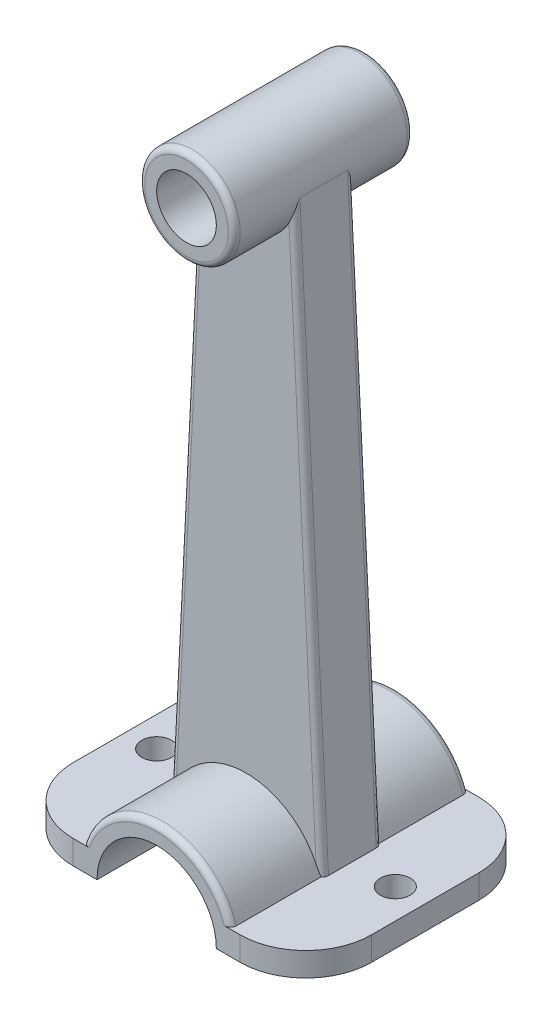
ISO-10303-21;
HEADER;
FILE_DESCRIPTION(('STEP AP214'),'2;1');
FILE_NAME('part.step','',(''),(''),'','','');
FILE_SCHEMA(('AUTOMOTIVE_DESIGN { 1 0 10303 214 1 1 1 1 }'));
ENDSEC;
DATA;
#1=APPLICATION_CONTEXT('core data for automotive mechanical design processes');
#2=APPLICATION_PROTOCOL_DEFINITION('international standard','automotive_design',2000,#1);
#3=PRODUCT_CONTEXT('',#1,'mechanical');
#4=PRODUCT('Part','Part','',(#3));
#5=PRODUCT_RELATED_PRODUCT_CATEGORY('part','',(#4));
#6=PRODUCT_DEFINITION_FORMATION('','',#4);
#7=PRODUCT_DEFINITION_CONTEXT('part definition',#1,'design');
#8=PRODUCT_DEFINITION('design','',#6,#7);
#9=PRODUCT_DEFINITION_SHAPE('','',#8);
#10=(LENGTH_UNIT() NAMED_UNIT(*) SI_UNIT(.MILLI.,.METRE.));
#11=(NAMED_UNIT(*) PLANE_ANGLE_UNIT() SI_UNIT($,.RADIAN.));
#12=(NAMED_UNIT(*) SI_UNIT($,.STERADIAN.) SOLID_ANGLE_UNIT());
#13=UNCERTAINTY_MEASURE_WITH_UNIT(LENGTH_MEASURE(1.E-05),#10,'distance_accuracy_value','');
#14=(GEOMETRIC_REPRESENTATION_CONTEXT(3) GLOBAL_UNCERTAINTY_ASSIGNED_CONTEXT((#13)) GLOBAL_UNIT_ASSIGNED_CONTEXT((#10,
#11,#12)) REPRESENTATION_CONTEXT('',''));
#15=CARTESIAN_POINT('',(0.,0.,0.));
#16=DIRECTION('',(0.,0.,1.));
#17=DIRECTION('',(1.,0.,0.));
#18=AXIS2_PLACEMENT_3D('',#15,#16,#17);
#19=CARTESIAN_POINT('',(0.,-127.,-25.4));
#20=DIRECTION('',(0.,0.,1.));
#21=DIRECTION('',(1.,0.,0.));
#22=AXIS2_PLACEMENT_3D('',#19,#20,#21);
#23=CYLINDRICAL_SURFACE('',#22,16.51);
#24=CARTESIAN_POINT('',(0.,-127.,24.13));
#25=DIRECTION('',(0.,0.,1.));
#26=DIRECTION('',(1.,0.,0.));
#27=AXIS2_PLACEMENT_3D('',#24,#25,#26);
#28=CIRCLE('',#27,16.51);
#29=CARTESIAN_POINT('',(-15.7090324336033,-121.92,24.13));
#30=VERTEX_POINT('',#29);
#31=CARTESIAN_POINT('',(15.7090324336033,-121.92,24.13));
#32=VERTEX_POINT('',#31);
#33=EDGE_CURVE('E534',#30,#32,#28,.F.);
#34=ORIENTED_EDGE('',*,*,#33,.T.);
#35=DIRECTION('',(0.,0.,1.));
#36=VECTOR('',#35,1.);
#37=CARTESIAN_POINT('',(15.7090324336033,-121.92,-25.4));
#38=LINE('',#37,#36);
#39=CARTESIAN_POINT('',(15.7090324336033,-121.92,6.12361716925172));
#40=VERTEX_POINT('',#39);
#41=EDGE_CURVE('E213',#32,#40,#38,.F.);
#42=ORIENTED_EDGE('',*,*,#41,.T.);
#43=CARTESIAN_POINT('',(16.4276558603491,-125.353117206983,5.08));
#44=CARTESIAN_POINT('',(16.4276572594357,-125.353131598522,5.08413584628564));
#45=CARTESIAN_POINT('',(16.42761556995,-125.352715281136,5.08825012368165));
#46=CARTESIAN_POINT('',(16.427459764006,-125.35116202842,5.09627322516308));
#47=CARTESIAN_POINT('',(16.4273468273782,-125.350036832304,5.10018429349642));
#48=CARTESIAN_POINT('',(16.4270142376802,-125.34672852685,5.10903643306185));
#49=CARTESIAN_POINT('',(16.4267716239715,-125.344318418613,5.11388939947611));
#50=CARTESIAN_POINT('',(16.4262118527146,-125.338773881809,5.12318583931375));
#51=CARTESIAN_POINT('',(16.4258941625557,-125.335634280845,5.12762605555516));
#52=CARTESIAN_POINT('',(16.4247198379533,-125.324069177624,5.142209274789));
#53=CARTESIAN_POINT('',(16.4237425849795,-125.314509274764,5.15141938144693));
#54=CARTESIAN_POINT('',(16.4216526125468,-125.29426463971,5.16846686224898));
#55=CARTESIAN_POINT('',(16.4205391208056,-125.283573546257,5.17629573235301));
#56=CARTESIAN_POINT('',(16.4170252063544,-125.250175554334,5.19880569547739));
#57=CARTESIAN_POINT('',(16.4144939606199,-125.226567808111,5.21211579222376));
#58=CARTESIAN_POINT('',(16.409227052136,-125.178471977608,5.23702077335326));
#59=CARTESIAN_POINT('',(16.4064907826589,-125.153981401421,5.24861023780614));
#60=CARTESIAN_POINT('',(16.3980282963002,-125.079782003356,5.28185432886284));
#61=CARTESIAN_POINT('',(16.3920545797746,-125.029404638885,5.30195203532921));
#62=CARTESIAN_POINT('',(16.3734398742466,-124.878495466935,5.35910219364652));
#63=CARTESIAN_POINT('',(16.359993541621,-124.777112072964,5.39350663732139));
#64=CARTESIAN_POINT('',(16.3310562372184,-124.573622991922,5.4594981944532));
#65=CARTESIAN_POINT('',(16.3155630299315,-124.471516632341,5.49108216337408));
#66=CARTESIAN_POINT('',(16.2826210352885,-124.267419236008,5.55230090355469));
#67=CARTESIAN_POINT('',(16.2651790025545,-124.165428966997,5.58194187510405));
#68=CARTESIAN_POINT('',(16.2283085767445,-123.961440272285,5.63982334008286));
#69=CARTESIAN_POINT('',(16.2088806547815,-123.859441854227,5.66806416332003));
#70=CARTESIAN_POINT('',(16.1554203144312,-123.592539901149,5.74035330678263));
#71=CARTESIAN_POINT('',(16.1197772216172,-123.42768249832,5.78339513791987));
#72=CARTESIAN_POINT('',(16.0432499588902,-123.098357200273,5.86623597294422));
#73=CARTESIAN_POINT('',(16.0023653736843,-122.933889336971,5.90603471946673));
#74=CARTESIAN_POINT('',(15.9153187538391,-122.605505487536,5.98202409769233));
#75=CARTESIAN_POINT('',(15.8691565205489,-122.441589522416,6.01821459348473));
#76=CARTESIAN_POINT('',(15.7715210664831,-122.114474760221,6.08642518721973));
#77=CARTESIAN_POINT('',(15.7200480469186,-121.95127593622,6.11844544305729));
#78=CARTESIAN_POINT('',(15.6113566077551,-121.624546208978,6.17779697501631));
#79=CARTESIAN_POINT('',(15.554098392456,-121.461021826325,6.20509169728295));
#80=CARTESIAN_POINT('',(15.4341618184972,-121.135113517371,6.25373445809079));
#81=CARTESIAN_POINT('',(15.3714846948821,-120.972729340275,6.27508384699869));
#82=CARTESIAN_POINT('',(15.2406030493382,-120.649044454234,6.31066199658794));
#83=CARTESIAN_POINT('',(15.1723890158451,-120.487746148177,6.32487818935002));
#84=CARTESIAN_POINT('',(15.0660589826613,-120.247099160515,6.33962551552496));
#85=CARTESIAN_POINT('',(15.0299308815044,-120.167065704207,6.34344535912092));
#86=CARTESIAN_POINT('',(14.9563653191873,-120.0075069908,6.34862962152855));
#87=CARTESIAN_POINT('',(14.918927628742,-119.927981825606,6.34999360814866));
#88=CARTESIAN_POINT('',(14.880851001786,-119.848750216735,6.35));
#89=B_SPLINE_CURVE_WITH_KNOTS('',3,(#43,#44,#45,#46,#47,#48,#49,#50,#51,#52,#53,#54,#55,#56,#57,
#58,#59,#60,#61,#62,#63,#64,#65,#66,#67,#68,#69,#70,#71,#72,#73,#74,#75,#76,#77,#78,#79,#80,#81,
#82,#83,#84,#85,#86,#87,#88),.UNSPECIFIED.,.F.,.F.,(4,2,2,2,2,2,2,2,2,2,2,2,2,2,2,2,2,2,2,2,2,2,
4),(0.,0.0123518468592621,0.0245043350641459,0.0406834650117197,0.056981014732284,
0.0966028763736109,0.136460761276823,0.217895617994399,0.29958178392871,0.463156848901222,
0.786756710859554,1.11071296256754,1.43357931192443,1.75636924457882,2.27846869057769,
2.80060952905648,3.32277002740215,3.84491074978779,4.37092562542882,4.89682092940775,
5.42363957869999,5.68727842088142,5.95096365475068),.UNSPECIFIED.);
#90=CARTESIAN_POINT('',(14.8808510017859,-119.848750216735,6.35));
#91=VERTEX_POINT('',#90);
#92=EDGE_CURVE('E334',#40,#91,#89,.T.);
#93=ORIENTED_EDGE('',*,*,#92,.T.);
#94=CARTESIAN_POINT('',(0.,-127.,6.35));
#95=DIRECTION('',(0.,0.,1.));
#96=DIRECTION('',(1.,0.,0.));
#97=AXIS2_PLACEMENT_3D('',#94,#95,#96);
#98=CIRCLE('',#97,16.51);
#99=CARTESIAN_POINT('',(-14.880851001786,-119.848750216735,6.35));
#100=VERTEX_POINT('',#99);
#101=EDGE_CURVE('E447',#91,#100,#98,.T.);
#102=ORIENTED_EDGE('',*,*,#101,.T.);
#103=CARTESIAN_POINT('',(-14.880851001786,-119.848750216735,6.35));
#104=CARTESIAN_POINT('',(-14.927370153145,-119.945547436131,6.34998424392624));
#105=CARTESIAN_POINT('',(-14.9729347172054,-120.042783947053,6.34795406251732));
#106=CARTESIAN_POINT('',(-15.0620965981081,-120.23798524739,6.34031247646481));
#107=CARTESIAN_POINT('',(-15.105694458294,-120.335949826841,6.33470206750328));
#108=CARTESIAN_POINT('',(-15.1908473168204,-120.532410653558,6.32035447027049));
#109=CARTESIAN_POINT('',(-15.232404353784,-120.630906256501,6.3116204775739));
#110=CARTESIAN_POINT('',(-15.3135037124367,-120.828443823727,6.2913765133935));
#111=CARTESIAN_POINT('',(-15.3530458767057,-120.927485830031,6.2798663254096));
#112=CARTESIAN_POINT('',(-15.4683441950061,-121.224582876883,6.24173684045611));
#113=CARTESIAN_POINT('',(-15.5410921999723,-121.423348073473,6.21145980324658));
#114=CARTESIAN_POINT('',(-15.678525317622,-121.822309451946,6.14307640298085));
#115=CARTESIAN_POINT('',(-15.7432091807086,-122.022505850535,6.10496882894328));
#116=CARTESIAN_POINT('',(-15.8563806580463,-122.396934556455,6.02793307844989));
#117=CARTESIAN_POINT('',(-15.9058761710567,-122.571029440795,5.98980781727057));
#118=CARTESIAN_POINT('',(-15.9989128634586,-122.919867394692,5.9094480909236));
#119=CARTESIAN_POINT('',(-16.042453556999,-123.094610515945,5.86721329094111));
#120=CARTESIAN_POINT('',(-16.1382736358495,-123.507728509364,5.76321006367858));
#121=CARTESIAN_POINT('',(-16.1880345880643,-123.746304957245,5.69989351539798));
#122=CARTESIAN_POINT('',(-16.2620879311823,-124.144985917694,5.5881689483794));
#123=CARTESIAN_POINT('',(-16.2893736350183,-124.305087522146,5.54170825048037));
#124=CARTESIAN_POINT('',(-16.3307305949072,-124.57122994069,5.46021535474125));
#125=CARTESIAN_POINT('',(-16.3461718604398,-124.67746959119,5.42654795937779));
#126=CARTESIAN_POINT('',(-16.3700174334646,-124.853454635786,5.36702267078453));
#127=CARTESIAN_POINT('',(-16.3790461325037,-124.923501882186,5.3423273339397));
#128=CARTESIAN_POINT('',(-16.3932170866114,-125.039208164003,5.29800587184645));
#129=CARTESIAN_POINT('',(-16.3986522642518,-125.085220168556,5.27943056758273));
#130=CARTESIAN_POINT('',(-16.4072817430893,-125.160939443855,5.24548431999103));
#131=CARTESIAN_POINT('',(-16.4106263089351,-125.191044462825,5.23106078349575));
#132=CARTESIAN_POINT('',(-16.4159714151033,-125.240345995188,5.2041891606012));
#133=CARTESIAN_POINT('',(-16.4180604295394,-125.259959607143,5.19257796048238));
#134=CARTESIAN_POINT('',(-16.4210441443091,-125.288419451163,5.1727408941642));
#135=CARTESIAN_POINT('',(-16.4220346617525,-125.297953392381,5.16552820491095));
#136=CARTESIAN_POINT('',(-16.423896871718,-125.316019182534,5.14991937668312));
#137=CARTESIAN_POINT('',(-16.4247691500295,-125.324555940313,5.14152952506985));
#138=CARTESIAN_POINT('',(-16.425827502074,-125.334977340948,5.12847864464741));
#139=CARTESIAN_POINT('',(-16.4261123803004,-125.337791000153,5.12458122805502));
#140=CARTESIAN_POINT('',(-16.4266272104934,-125.342886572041,5.11644412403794));
#141=CARTESIAN_POINT('',(-16.4268572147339,-125.345168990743,5.11220476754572));
#142=CARTESIAN_POINT('',(-16.4272061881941,-125.348637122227,5.10419516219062));
#143=CARTESIAN_POINT('',(-16.4273377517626,-125.349946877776,5.10048014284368));
#144=CARTESIAN_POINT('',(-16.4275364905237,-125.351926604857,5.09288564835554));
#145=CARTESIAN_POINT('',(-16.427603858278,-125.352598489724,5.08900670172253));
#146=CARTESIAN_POINT('',(-16.4276490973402,-125.353049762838,5.08340469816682));
#147=CARTESIAN_POINT('',(-16.4276560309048,-125.353118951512,5.08170219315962));
#148=CARTESIAN_POINT('',(-16.4276558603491,-125.353117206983,5.07999999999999));
#149=B_SPLINE_CURVE_WITH_KNOTS('',3,(#103,#104,#105,#106,#107,#108,#109,#110,#111,#112,#113,
#114,#115,#116,#117,#118,#119,#120,#121,#122,#123,#124,#125,#126,#127,#128,#129,#130,#131,#132,
#133,#134,#135,#136,#137,#138,#139,#140,#141,#142,#143,#144,#145,#146,#147,#148),.UNSPECIFIED.,
.F.,.F.,(4,2,2,2,2,2,2,2,2,2,2,2,2,2,2,2,2,2,2,2,2,2,4),(0.,0.322136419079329,0.644183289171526,
0.965901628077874,1.28764506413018,1.92871336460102,2.56988088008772,3.12462804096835,
3.67942043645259,4.43446438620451,4.94113329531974,5.27860187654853,5.5030089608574,
5.6526800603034,5.75325851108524,5.82176216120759,5.85771373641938,5.89348012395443,
5.90789681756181,5.92229972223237,5.93407885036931,5.94582253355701,5.95092907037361),.UNSPECIFIED.);
#150=CARTESIAN_POINT('',(-15.7090324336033,-121.92,6.12361716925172));
#151=VERTEX_POINT('',#150);
#152=EDGE_CURVE('E544',#100,#151,#149,.T.);
#153=ORIENTED_EDGE('',*,*,#152,.T.);
#154=DIRECTION('',(0.,0.,1.));
#155=VECTOR('',#154,1.);
#156=CARTESIAN_POINT('',(-15.7090324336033,-121.92,-25.4));
#157=LINE('',#156,#155);
#158=EDGE_CURVE('E565',#151,#30,#157,.T.);
#159=ORIENTED_EDGE('',*,*,#158,.T.);
#160=EDGE_LOOP('',(#34,#42,#93,#102,#153,#159));
#161=FACE_BOUND('',#160,.T.);
#162=ADVANCED_FACE('F35',(#161),#23,.T.);
#163=CARTESIAN_POINT('',(14.880851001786,-119.848750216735,-6.35));
#164=CARTESIAN_POINT('',(14.927370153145,-119.945547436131,-6.34998424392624));
#165=CARTESIAN_POINT('',(14.9729347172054,-120.042783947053,-6.34795406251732));
#166=CARTESIAN_POINT('',(15.0620965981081,-120.23798524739,-6.34031247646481));
#167=CARTESIAN_POINT('',(15.105694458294,-120.335949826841,-6.33470206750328));
#168=CARTESIAN_POINT('',(15.1908473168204,-120.532410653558,-6.32035447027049));
#169=CARTESIAN_POINT('',(15.232404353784,-120.630906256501,-6.3116204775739));
#170=CARTESIAN_POINT('',(15.3135037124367,-120.828443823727,-6.2913765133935));
#171=CARTESIAN_POINT('',(15.3530458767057,-120.927485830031,-6.2798663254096));
#172=CARTESIAN_POINT('',(15.4683441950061,-121.224582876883,-6.24173684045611));
#173=CARTESIAN_POINT('',(15.5410921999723,-121.423348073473,-6.21145980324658));
#174=CARTESIAN_POINT('',(15.678525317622,-121.822309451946,-6.14307640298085));
#175=CARTESIAN_POINT('',(15.7432091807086,-122.022505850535,-6.10496882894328));
#176=CARTESIAN_POINT('',(15.8563806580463,-122.396934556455,-6.02793307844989));
#177=CARTESIAN_POINT('',(15.9058761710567,-122.571029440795,-5.98980781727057));
#178=CARTESIAN_POINT('',(15.9989128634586,-122.919867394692,-5.9094480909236));
#179=CARTESIAN_POINT('',(16.042453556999,-123.094610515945,-5.86721329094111));
#180=CARTESIAN_POINT('',(16.1382736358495,-123.507728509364,-5.76321006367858));
#181=CARTESIAN_POINT('',(16.1880345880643,-123.746304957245,-5.69989351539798));
#182=CARTESIAN_POINT('',(16.2620879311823,-124.144985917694,-5.5881689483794));
#183=CARTESIAN_POINT('',(16.2893736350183,-124.305087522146,-5.54170825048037));
#184=CARTESIAN_POINT('',(16.3307305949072,-124.57122994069,-5.46021535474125));
#185=CARTESIAN_POINT('',(16.3461718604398,-124.67746959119,-5.42654795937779));
#186=CARTESIAN_POINT('',(16.3700174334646,-124.853454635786,-5.36702267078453));
#187=CARTESIAN_POINT('',(16.3790461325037,-124.923501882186,-5.3423273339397));
#188=CARTESIAN_POINT('',(16.3932170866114,-125.039208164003,-5.29800587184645));
#189=CARTESIAN_POINT('',(16.3986522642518,-125.085220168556,-5.27943056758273));
#190=CARTESIAN_POINT('',(16.4072817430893,-125.160939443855,-5.24548431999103));
#191=CARTESIAN_POINT('',(16.4106263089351,-125.191044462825,-5.23106078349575));
#192=CARTESIAN_POINT('',(16.4159714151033,-125.240345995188,-5.2041891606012));
#193=CARTESIAN_POINT('',(16.4180604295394,-125.259959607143,-5.19257796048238));
#194=CARTESIAN_POINT('',(16.4210441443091,-125.288419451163,-5.1727408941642));
#195=CARTESIAN_POINT('',(16.4220346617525,-125.297953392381,-5.16552820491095));
#196=CARTESIAN_POINT('',(16.423896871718,-125.316019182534,-5.14991937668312));
#197=CARTESIAN_POINT('',(16.4247691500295,-125.324555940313,-5.14152952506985));
#198=CARTESIAN_POINT('',(16.425827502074,-125.334977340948,-5.12847864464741));
#199=CARTESIAN_POINT('',(16.4261123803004,-125.337791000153,-5.12458122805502));
#200=CARTESIAN_POINT('',(16.4266272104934,-125.342886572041,-5.11644412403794));
#201=CARTESIAN_POINT('',(16.4268572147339,-125.345168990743,-5.11220476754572));
#202=CARTESIAN_POINT('',(16.4272061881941,-125.348637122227,-5.10419516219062));
#203=CARTESIAN_POINT('',(16.4273377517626,-125.349946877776,-5.10048014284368));
#204=CARTESIAN_POINT('',(16.4275364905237,-125.351926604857,-5.09288564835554));
#205=CARTESIAN_POINT('',(16.427603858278,-125.352598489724,-5.08900670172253));
#206=CARTESIAN_POINT('',(16.4276490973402,-125.353049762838,-5.08340469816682));
#207=CARTESIAN_POINT('',(16.4276560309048,-125.353118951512,-5.08170219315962));
#208=CARTESIAN_POINT('',(16.4276558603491,-125.353117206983,-5.07999999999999));
#209=B_SPLINE_CURVE_WITH_KNOTS('',3,(#163,#164,#165,#166,#167,#168,#169,#170,#171,#172,#173,
#174,#175,#176,#177,#178,#179,#180,#181,#182,#183,#184,#185,#186,#187,#188,#189,#190,#191,#192,
#193,#194,#195,#196,#197,#198,#199,#200,#201,#202,#203,#204,#205,#206,#207,#208),.UNSPECIFIED.,
.F.,.F.,(4,2,2,2,2,2,2,2,2,2,2,2,2,2,2,2,2,2,2,2,2,2,4),(0.,0.322136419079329,0.644183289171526,
0.965901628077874,1.28764506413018,1.92871336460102,2.56988088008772,3.12462804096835,
3.67942043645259,4.43446438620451,4.94113329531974,5.27860187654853,5.5030089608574,
5.6526800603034,5.75325851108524,5.82176216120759,5.85771373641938,5.89348012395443,
5.90789681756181,5.92229972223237,5.93407885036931,5.94582253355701,5.95092907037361),.UNSPECIFIED.);
#210=CARTESIAN_POINT('',(14.880851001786,-119.848750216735,-6.35));
#211=VERTEX_POINT('',#210);
#212=CARTESIAN_POINT('',(15.7090324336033,-121.92,-6.12361716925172));
#213=VERTEX_POINT('',#212);
#214=EDGE_CURVE('E345',#211,#213,#209,.T.);
#215=ORIENTED_EDGE('',*,*,#214,.T.);
#216=CARTESIAN_POINT('',(15.7090324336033,-121.92,-24.13));
#217=VERTEX_POINT('',#216);
#218=EDGE_CURVE('E529',#213,#217,#38,.F.);
#219=ORIENTED_EDGE('',*,*,#218,.T.);
#220=CARTESIAN_POINT('',(0.,-127.,-24.13));
#221=DIRECTION('',(0.,0.,1.));
#222=DIRECTION('',(1.,0.,0.));
#223=AXIS2_PLACEMENT_3D('',#220,#221,#222);
#224=CIRCLE('',#223,16.51);
#225=CARTESIAN_POINT('',(-15.7090324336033,-121.92,-24.13));
#226=VERTEX_POINT('',#225);
#227=EDGE_CURVE('E229',#217,#226,#224,.T.);
#228=ORIENTED_EDGE('',*,*,#227,.T.);
#229=CARTESIAN_POINT('',(-15.7090324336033,-121.92,-6.12361716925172));
#230=VERTEX_POINT('',#229);
#231=EDGE_CURVE('E272',#226,#230,#157,.T.);
#232=ORIENTED_EDGE('',*,*,#231,.T.);
#233=CARTESIAN_POINT('',(-16.4276558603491,-125.353117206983,-5.08));
#234=CARTESIAN_POINT('',(-16.4276572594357,-125.353131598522,-5.08413584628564));
#235=CARTESIAN_POINT('',(-16.42761556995,-125.352715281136,-5.08825012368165));
#236=CARTESIAN_POINT('',(-16.427459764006,-125.35116202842,-5.09627322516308));
#237=CARTESIAN_POINT('',(-16.4273468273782,-125.350036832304,-5.10018429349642));
#238=CARTESIAN_POINT('',(-16.4270142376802,-125.34672852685,-5.10903643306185));
#239=CARTESIAN_POINT('',(-16.4267716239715,-125.344318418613,-5.11388939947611));
#240=CARTESIAN_POINT('',(-16.4262118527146,-125.338773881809,-5.12318583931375));
#241=CARTESIAN_POINT('',(-16.4258941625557,-125.335634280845,-5.12762605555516));
#242=CARTESIAN_POINT('',(-16.4247198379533,-125.324069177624,-5.142209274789));
#243=CARTESIAN_POINT('',(-16.4237425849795,-125.314509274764,-5.15141938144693));
#244=CARTESIAN_POINT('',(-16.4216526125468,-125.29426463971,-5.16846686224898));
#245=CARTESIAN_POINT('',(-16.4205391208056,-125.283573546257,-5.17629573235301));
#246=CARTESIAN_POINT('',(-16.4170252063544,-125.250175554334,-5.19880569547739));
#247=CARTESIAN_POINT('',(-16.4144939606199,-125.226567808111,-5.21211579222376));
#248=CARTESIAN_POINT('',(-16.409227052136,-125.178471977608,-5.23702077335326));
#249=CARTESIAN_POINT('',(-16.4064907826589,-125.153981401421,-5.24861023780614));
#250=CARTESIAN_POINT('',(-16.3980282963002,-125.079782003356,-5.28185432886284));
#251=CARTESIAN_POINT('',(-16.3920545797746,-125.029404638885,-5.30195203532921));
#252=CARTESIAN_POINT('',(-16.3734398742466,-124.878495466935,-5.35910219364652));
#253=CARTESIAN_POINT('',(-16.359993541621,-124.777112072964,-5.39350663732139));
#254=CARTESIAN_POINT('',(-16.3310562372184,-124.573622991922,-5.4594981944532));
#255=CARTESIAN_POINT('',(-16.3155630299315,-124.471516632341,-5.49108216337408));
#256=CARTESIAN_POINT('',(-16.2826210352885,-124.267419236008,-5.55230090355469));
#257=CARTESIAN_POINT('',(-16.2651790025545,-124.165428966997,-5.58194187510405));
#258=CARTESIAN_POINT('',(-16.2283085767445,-123.961440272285,-5.63982334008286));
#259=CARTESIAN_POINT('',(-16.2088806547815,-123.859441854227,-5.66806416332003));
#260=CARTESIAN_POINT('',(-16.1554203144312,-123.592539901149,-5.74035330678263));
#261=CARTESIAN_POINT('',(-16.1197772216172,-123.42768249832,-5.78339513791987));
#262=CARTESIAN_POINT('',(-16.0432499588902,-123.098357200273,-5.86623597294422));
#263=CARTESIAN_POINT('',(-16.0023653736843,-122.933889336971,-5.90603471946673));
#264=CARTESIAN_POINT('',(-15.9153187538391,-122.605505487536,-5.98202409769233));
#265=CARTESIAN_POINT('',(-15.8691565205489,-122.441589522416,-6.01821459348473));
#266=CARTESIAN_POINT('',(-15.7715210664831,-122.114474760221,-6.08642518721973));
#267=CARTESIAN_POINT('',(-15.7200480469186,-121.95127593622,-6.11844544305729));
#268=CARTESIAN_POINT('',(-15.6113566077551,-121.624546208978,-6.17779697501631));
#269=CARTESIAN_POINT('',(-15.554098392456,-121.461021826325,-6.20509169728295));
#270=CARTESIAN_POINT('',(-15.4341618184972,-121.135113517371,-6.25373445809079));
#271=CARTESIAN_POINT('',(-15.3714846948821,-120.972729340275,-6.27508384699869));
#272=CARTESIAN_POINT('',(-15.2406030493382,-120.649044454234,-6.31066199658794));
#273=CARTESIAN_POINT('',(-15.1723890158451,-120.487746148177,-6.32487818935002));
#274=CARTESIAN_POINT('',(-15.0660589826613,-120.247099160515,-6.33962551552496));
#275=CARTESIAN_POINT('',(-15.0299308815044,-120.167065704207,-6.34344535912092));
#276=CARTESIAN_POINT('',(-14.9563653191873,-120.0075069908,-6.34862962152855));
#277=CARTESIAN_POINT('',(-14.918927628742,-119.927981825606,-6.34999360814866));
#278=CARTESIAN_POINT('',(-14.880851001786,-119.848750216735,-6.35));
#279=B_SPLINE_CURVE_WITH_KNOTS('',3,(#233,#234,#235,#236,#237,#238,#239,#240,#241,#242,#243,
#244,#245,#246,#247,#248,#249,#250,#251,#252,#253,#254,#255,#256,#257,#258,#259,#260,#261,#262,
#263,#264,#265,#266,#267,#268,#269,#270,#271,#272,#273,#274,#275,#276,#277,#278),.UNSPECIFIED.,
.F.,.F.,(4,2,2,2,2,2,2,2,2,2,2,2,2,2,2,2,2,2,2,2,2,2,4),(0.,0.0123518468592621,
0.0245043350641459,0.0406834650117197,0.056981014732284,0.0966028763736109,0.136460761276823,
0.217895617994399,0.29958178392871,0.463156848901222,0.786756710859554,1.11071296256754,
1.43357931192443,1.75636924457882,2.27846869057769,2.80060952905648,3.32277002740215,
3.84491074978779,4.37092562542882,4.89682092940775,5.42363957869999,5.68727842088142,
5.95096365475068),.UNSPECIFIED.);
#280=CARTESIAN_POINT('',(-14.8808510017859,-119.848750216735,-6.35));
#281=VERTEX_POINT('',#280);
#282=EDGE_CURVE('E353',#230,#281,#279,.T.);
#283=ORIENTED_EDGE('',*,*,#282,.T.);
#284=CARTESIAN_POINT('',(0.,-127.,-6.35));
#285=DIRECTION('',(0.,0.,1.));
#286=DIRECTION('',(1.,0.,0.));
#287=AXIS2_PLACEMENT_3D('',#284,#285,#286);
#288=CIRCLE('',#287,16.51);
#289=EDGE_CURVE('E442',#211,#281,#288,.T.);
#290=ORIENTED_EDGE('',*,*,#289,.F.);
#291=EDGE_LOOP('',(#215,#219,#228,#232,#283,#290));
#292=FACE_BOUND('',#291,.T.);
#293=ADVANCED_FACE('F280',(#292),#23,.T.);
#294=CARTESIAN_POINT('',(0.,-127.,-24.13));
#295=DIRECTION('',(0.,0.,1.));
#296=DIRECTION('',(1.,0.,0.));
#297=AXIS2_PLACEMENT_3D('',#294,#295,#296);
#298=TOROIDAL_SURFACE('',#297,15.24,1.27);
#299=ORIENTED_EDGE('',*,*,#227,.F.);
#300=CARTESIAN_POINT('',(13.1907162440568,-121.92,-24.7561970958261));
#301=CARTESIAN_POINT('',(13.1555043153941,-121.92,-24.6982145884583));
#302=CARTESIAN_POINT('',(13.1249942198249,-121.92,-24.6373394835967));
#303=CARTESIAN_POINT('',(13.0745137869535,-121.92,-24.5113254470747));
#304=CARTESIAN_POINT('',(13.0545487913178,-121.92,-24.4461843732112));
#305=CARTESIAN_POINT('',(13.0259542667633,-121.92,-24.3133705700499));
#306=CARTESIAN_POINT('',(13.0173374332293,-121.92,-24.2456950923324));
#307=CARTESIAN_POINT('',(13.0118484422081,-121.92,-24.109879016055));
#308=CARTESIAN_POINT('',(13.014974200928,-121.92,-24.0417385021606));
#309=CARTESIAN_POINT('',(13.0326585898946,-121.92,-23.9082956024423));
#310=CARTESIAN_POINT('',(13.0469973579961,-121.92,-23.8429638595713));
#311=CARTESIAN_POINT('',(13.0862691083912,-121.92,-23.7155750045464));
#312=CARTESIAN_POINT('',(13.1112027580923,-121.92,-23.6535180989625));
#313=CARTESIAN_POINT('',(13.1712346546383,-121.92,-23.5332722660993));
#314=CARTESIAN_POINT('',(13.2064926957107,-121.92,-23.4751633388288));
#315=CARTESIAN_POINT('',(13.2857927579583,-121.92,-23.3652960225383));
#316=CARTESIAN_POINT('',(13.3298366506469,-121.92,-23.3135389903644));
#317=CARTESIAN_POINT('',(13.4279356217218,-121.92,-23.2148488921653));
#318=CARTESIAN_POINT('',(13.4824014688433,-121.92,-23.1683244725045));
#319=CARTESIAN_POINT('',(13.5979668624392,-121.92,-23.0844200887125));
#320=CARTESIAN_POINT('',(13.6590683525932,-121.92,-23.0470428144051));
#321=CARTESIAN_POINT('',(13.7903619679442,-121.92,-22.9800158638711));
#322=CARTESIAN_POINT('',(13.8608857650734,-121.92,-22.9510152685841));
#323=CARTESIAN_POINT('',(14.0056676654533,-121.92,-22.9046731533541));
#324=CARTESIAN_POINT('',(14.0799267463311,-121.92,-22.8873347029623));
#325=CARTESIAN_POINT('',(14.2337133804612,-121.92,-22.8641415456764));
#326=CARTESIAN_POINT('',(14.3133263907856,-121.92,-22.8588497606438));
#327=CARTESIAN_POINT('',(14.4723346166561,-121.92,-22.8615677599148));
#328=CARTESIAN_POINT('',(14.5517298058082,-121.92,-22.8695790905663));
#329=CARTESIAN_POINT('',(14.7087635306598,-121.92,-22.8989653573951));
#330=CARTESIAN_POINT('',(14.7863798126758,-121.92,-22.9204599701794));
#331=CARTESIAN_POINT('',(14.9367362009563,-121.92,-22.9765539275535));
#332=CARTESIAN_POINT('',(15.0094768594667,-121.92,-23.0111517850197));
#333=CARTESIAN_POINT('',(15.1456964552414,-121.92,-23.0915358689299));
#334=CARTESIAN_POINT('',(15.2093812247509,-121.92,-23.1369726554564));
#335=CARTESIAN_POINT('',(15.3276962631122,-121.92,-23.2384185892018));
#336=CARTESIAN_POINT('',(15.3823292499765,-121.92,-23.2944245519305));
#337=CARTESIAN_POINT('',(15.4780054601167,-121.92,-23.4123865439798));
#338=CARTESIAN_POINT('',(15.5195962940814,-121.92,-23.4738983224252));
#339=CARTESIAN_POINT('',(15.5912295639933,-121.92,-23.6033160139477));
#340=CARTESIAN_POINT('',(15.621275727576,-121.92,-23.671219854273));
#341=CARTESIAN_POINT('',(15.6674699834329,-121.92,-23.8078660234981));
#342=CARTESIAN_POINT('',(15.6842307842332,-121.92,-23.8764015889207));
#343=CARTESIAN_POINT('',(15.7056265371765,-121.92,-24.015337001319));
#344=CARTESIAN_POINT('',(15.7102639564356,-121.92,-24.0857364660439));
#345=CARTESIAN_POINT('',(15.7072851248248,-121.92,-24.2242319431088));
#346=CARTESIAN_POINT('',(15.7000187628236,-121.92,-24.2923357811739));
#347=CARTESIAN_POINT('',(15.6741547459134,-121.92,-24.4263505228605));
#348=CARTESIAN_POINT('',(15.6555575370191,-121.92,-24.4922615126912));
#349=CARTESIAN_POINT('',(15.6076726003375,-121.92,-24.6201068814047));
#350=CARTESIAN_POINT('',(15.5783793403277,-121.92,-24.6820391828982));
#351=CARTESIAN_POINT('',(15.510085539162,-121.92,-24.8002890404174));
#352=CARTESIAN_POINT('',(15.4710840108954,-121.92,-24.8566060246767));
#353=CARTESIAN_POINT('',(15.3833694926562,-121.92,-24.9637809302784));
#354=CARTESIAN_POINT('',(15.3344128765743,-121.92,-25.014439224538));
#355=CARTESIAN_POINT('',(15.2290265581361,-121.92,-25.1072613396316));
#356=CARTESIAN_POINT('',(15.1725953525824,-121.92,-25.1494234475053));
#357=CARTESIAN_POINT('',(15.0510719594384,-121.92,-25.2261649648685));
#358=CARTESIAN_POINT('',(14.9856985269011,-121.92,-25.2602988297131));
#359=CARTESIAN_POINT('',(14.8503481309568,-121.92,-25.3177038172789));
#360=CARTESIAN_POINT('',(14.7803700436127,-121.92,-25.3409722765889));
#361=CARTESIAN_POINT('',(14.6340617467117,-121.92,-25.3771618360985));
#362=CARTESIAN_POINT('',(14.557588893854,-121.92,-25.3895070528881));
#363=CARTESIAN_POINT('',(14.4036525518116,-121.92,-25.4016571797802));
#364=CARTESIAN_POINT('',(14.3261888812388,-121.92,-25.4014597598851));
#365=CARTESIAN_POINT('',(14.1696322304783,-121.92,-25.3883678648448));
#366=CARTESIAN_POINT('',(14.0905755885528,-121.92,-25.3750343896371));
#367=CARTESIAN_POINT('',(13.9357779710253,-121.92,-25.3353088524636));
#368=CARTESIAN_POINT('',(13.8600381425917,-121.92,-25.3089123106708));
#369=CARTESIAN_POINT('',(13.7140179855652,-121.92,-25.2435543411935));
#370=CARTESIAN_POINT('',(13.6437474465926,-121.92,-25.2045709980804));
#371=CARTESIAN_POINT('',(13.5111688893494,-121.92,-25.1149215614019));
#372=CARTESIAN_POINT('',(13.4488500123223,-121.92,-25.0642716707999));
#373=CARTESIAN_POINT('',(13.3530784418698,-121.92,-24.9707845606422));
#374=CARTESIAN_POINT('',(13.3168328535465,-121.92,-24.9307714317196));
#375=CARTESIAN_POINT('',(13.2496412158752,-121.92,-24.8465129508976));
#376=CARTESIAN_POINT('',(13.2186945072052,-121.92,-24.8022681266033));
#377=CARTESIAN_POINT('',(13.1907162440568,-121.92,-24.7561970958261));
#378=B_SPLINE_CURVE_WITH_KNOTS('',3,(#300,#301,#302,#303,#304,#305,#306,#307,#308,#309,#310,
#311,#312,#313,#314,#315,#316,#317,#318,#319,#320,#321,#322,#323,#324,#325,#326,#327,#328,#329,
#330,#331,#332,#333,#334,#335,#336,#337,#338,#339,#340,#341,#342,#343,#344,#345,#346,#347,#348,
#349,#350,#351,#352,#353,#354,#355,#356,#357,#358,#359,#360,#361,#362,#363,#364,#365,#366,#367,
#368,#369,#370,#371,#372,#373,#374,#375,#376,#377),.UNSPECIFIED.,.T.,.F.,(4,2,2,2,2,2,2,2,2,2,2,
2,2,2,2,2,2,2,2,2,2,2,2,2,2,2,2,2,2,2,2,2,2,2,2,2,2,2,4),(0.,0.203327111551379,
0.406757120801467,0.610414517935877,0.814035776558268,1.01376162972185,1.21350006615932,
1.41650996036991,1.61956314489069,1.83352709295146,2.04755388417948,2.27530262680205,
2.50311129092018,2.74136398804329,2.97964438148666,3.22007025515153,3.46046885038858,
3.69397100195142,3.92740291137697,4.1490275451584,4.37058055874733,4.58119965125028,
4.79177587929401,4.99627293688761,5.20076194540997,5.40535687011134,5.60997260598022,
5.8203797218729,6.03082921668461,6.25109723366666,6.47141921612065,6.70276328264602,
6.93415032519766,7.17354186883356,7.41301556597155,7.6529084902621,7.89247022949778,
8.05404751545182,8.21560468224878),.UNSPECIFIED.);
#379=CARTESIAN_POINT('',(14.3684097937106,-121.92,-25.4));
#380=VERTEX_POINT('',#379);
#381=EDGE_CURVE('E287',#217,#380,#378,.T.);
#382=ORIENTED_EDGE('',*,*,#381,.T.);
#383=CARTESIAN_POINT('',(0.,-127.,-25.4));
#384=DIRECTION('',(0.,0.,1.));
#385=DIRECTION('',(1.,0.,0.));
#386=AXIS2_PLACEMENT_3D('',#383,#384,#385);
#387=CIRCLE('',#386,15.24);
#388=CARTESIAN_POINT('',(-14.3684097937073,-121.92,-25.4));
#389=VERTEX_POINT('',#388);
#390=EDGE_CURVE('E223',#389,#380,#387,.F.);
#391=ORIENTED_EDGE('',*,*,#390,.F.);
#392=CARTESIAN_POINT('',(-15.68418246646,-121.92,-24.373912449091));
#393=CARTESIAN_POINT('',(-15.6979102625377,-121.92,-24.3071624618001));
#394=CARTESIAN_POINT('',(-15.7060155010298,-121.92,-24.2392078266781));
#395=CARTESIAN_POINT('',(-15.7106557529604,-121.92,-24.1028551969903));
#396=CARTESIAN_POINT('',(-15.70717862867,-121.92,-24.0344568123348));
#397=CARTESIAN_POINT('',(-15.6887695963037,-121.92,-23.8992680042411));
#398=CARTESIAN_POINT('',(-15.6738460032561,-121.92,-23.8324764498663));
#399=CARTESIAN_POINT('',(-15.633085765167,-121.92,-23.7023342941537));
#400=CARTESIAN_POINT('',(-15.6072509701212,-121.92,-23.6389831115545));
#401=CARTESIAN_POINT('',(-15.5452966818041,-121.92,-23.5168883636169));
#402=CARTESIAN_POINT('',(-15.5090953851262,-121.92,-23.4581863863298));
#403=CARTESIAN_POINT('',(-15.4276717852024,-121.92,-23.3474213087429));
#404=CARTESIAN_POINT('',(-15.3824480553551,-121.92,-23.2953592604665));
#405=CARTESIAN_POINT('',(-15.2825813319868,-121.92,-23.19731734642));
#406=CARTESIAN_POINT('',(-15.2276586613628,-121.92,-23.151622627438));
#407=CARTESIAN_POINT('',(-15.1112303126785,-121.92,-23.0695859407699));
#408=CARTESIAN_POINT('',(-15.0497231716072,-121.92,-23.0332460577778));
#409=CARTESIAN_POINT('',(-14.9186201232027,-121.92,-22.9690367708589));
#410=CARTESIAN_POINT('',(-14.8487741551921,-121.92,-22.9416779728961));
#411=CARTESIAN_POINT('',(-14.7056077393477,-121.92,-22.8984818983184));
#412=CARTESIAN_POINT('',(-14.632286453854,-121.92,-22.8826474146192));
#413=CARTESIAN_POINT('',(-14.480572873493,-121.92,-22.8622509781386));
#414=CARTESIAN_POINT('',(-14.40210428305,-121.92,-22.8582543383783));
#415=CARTESIAN_POINT('',(-14.2455617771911,-121.92,-22.8631363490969));
#416=CARTESIAN_POINT('',(-14.1674879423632,-121.92,-22.8720175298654));
#417=CARTESIAN_POINT('',(-14.0118964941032,-121.92,-22.9028263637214));
#418=CARTESIAN_POINT('',(-13.9344425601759,-121.92,-22.9250773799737));
#419=CARTESIAN_POINT('',(-13.7844275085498,-121.92,-22.9824231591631));
#420=CARTESIAN_POINT('',(-13.7118665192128,-121.92,-23.0175182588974));
#421=CARTESIAN_POINT('',(-13.5748119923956,-121.92,-23.0992821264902));
#422=CARTESIAN_POINT('',(-13.510227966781,-121.92,-23.1457987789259));
#423=CARTESIAN_POINT('',(-13.3903240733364,-121.92,-23.249558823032));
#424=CARTESIAN_POINT('',(-13.3350015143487,-121.92,-23.3067990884));
#425=CARTESIAN_POINT('',(-13.2383867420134,-121.92,-23.4272793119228));
#426=CARTESIAN_POINT('',(-13.1965160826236,-121.92,-23.4900547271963));
#427=CARTESIAN_POINT('',(-13.1248035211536,-121.92,-23.6221386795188));
#428=CARTESIAN_POINT('',(-13.0949557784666,-121.92,-23.6914440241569));
#429=CARTESIAN_POINT('',(-13.0502086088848,-121.92,-23.8295741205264));
#430=CARTESIAN_POINT('',(-13.0344382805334,-121.92,-23.8981172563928));
#431=CARTESIAN_POINT('',(-13.0152247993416,-121.92,-24.0369048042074));
#432=CARTESIAN_POINT('',(-13.0117777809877,-121.92,-24.1071486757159));
#433=CARTESIAN_POINT('',(-13.0172323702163,-121.92,-24.2440254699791));
#434=CARTESIAN_POINT('',(-13.0255943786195,-121.92,-24.3106806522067));
#435=CARTESIAN_POINT('',(-13.0533631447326,-121.92,-24.441640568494));
#436=CARTESIAN_POINT('',(-13.0727695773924,-121.92,-24.5059453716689));
#437=CARTESIAN_POINT('',(-13.1219539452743,-121.92,-24.6306828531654));
#438=CARTESIAN_POINT('',(-13.1517652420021,-121.92,-24.6911023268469));
#439=CARTESIAN_POINT('',(-13.2206794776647,-121.92,-24.8063764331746));
#440=CARTESIAN_POINT('',(-13.2597840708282,-121.92,-24.8612300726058));
#441=CARTESIAN_POINT('',(-13.3480195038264,-121.92,-24.9665566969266));
#442=CARTESIAN_POINT('',(-13.3975286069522,-121.92,-25.0167123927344));
#443=CARTESIAN_POINT('',(-13.5038122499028,-121.92,-25.1086123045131));
#444=CARTESIAN_POINT('',(-13.5605888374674,-121.92,-25.1503541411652));
#445=CARTESIAN_POINT('',(-13.6836922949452,-121.92,-25.2270564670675));
#446=CARTESIAN_POINT('',(-13.7503984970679,-121.92,-25.2614083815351));
#447=CARTESIAN_POINT('',(-13.8884217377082,-121.92,-25.3190780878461));
#448=CARTESIAN_POINT('',(-13.9597400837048,-121.92,-25.3423927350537));
#449=CARTESIAN_POINT('',(-14.1090262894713,-121.92,-25.3784918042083));
#450=CARTESIAN_POINT('',(-14.1871460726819,-121.92,-25.3906502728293));
#451=CARTESIAN_POINT('',(-14.3443295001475,-121.92,-25.4019667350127));
#452=CARTESIAN_POINT('',(-14.4233932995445,-121.92,-25.401122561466));
#453=CARTESIAN_POINT('',(-14.5818613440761,-121.92,-25.3862248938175));
#454=CARTESIAN_POINT('',(-14.661241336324,-121.92,-25.371910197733));
#455=CARTESIAN_POINT('',(-14.8163859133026,-121.92,-25.3298953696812));
#456=CARTESIAN_POINT('',(-14.8921508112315,-121.92,-25.3021963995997));
#457=CARTESIAN_POINT('',(-15.0362398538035,-121.92,-25.2346230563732));
#458=CARTESIAN_POINT('',(-15.1046809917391,-121.92,-25.1949987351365));
#459=CARTESIAN_POINT('',(-15.2335232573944,-121.92,-25.1042749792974));
#460=CARTESIAN_POINT('',(-15.2939243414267,-121.92,-25.0531754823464));
#461=CARTESIAN_POINT('',(-15.4018902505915,-121.92,-24.9434748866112));
#462=CARTESIAN_POINT('',(-15.4499204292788,-121.92,-24.8853315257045));
#463=CARTESIAN_POINT('',(-15.534839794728,-121.92,-24.7614855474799));
#464=CARTESIAN_POINT('',(-15.5717475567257,-121.92,-24.6957957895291));
#465=CARTESIAN_POINT('',(-15.620562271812,-121.92,-24.5867604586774));
#466=CARTESIAN_POINT('',(-15.636533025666,-121.92,-24.5451885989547));
#467=CARTESIAN_POINT('',(-15.6638620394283,-121.92,-24.4605530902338));
#468=CARTESIAN_POINT('',(-15.6752204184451,-121.92,-24.4174894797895));
#469=CARTESIAN_POINT('',(-15.68418246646,-121.92,-24.373912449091));
#470=B_SPLINE_CURVE_WITH_KNOTS('',3,(#392,#393,#394,#395,#396,#397,#398,#399,#400,#401,#402,
#403,#404,#405,#406,#407,#408,#409,#410,#411,#412,#413,#414,#415,#416,#417,#418,#419,#420,#421,
#422,#423,#424,#425,#426,#427,#428,#429,#430,#431,#432,#433,#434,#435,#436,#437,#438,#439,#440,
#441,#442,#443,#444,#445,#446,#447,#448,#449,#450,#451,#452,#453,#454,#455,#456,#457,#458,#459,
#460,#461,#462,#463,#464,#465,#466,#467,#468,#469),.UNSPECIFIED.,.T.,.F.,(4,2,2,2,2,2,2,2,2,2,2,
2,2,2,2,2,2,2,2,2,2,2,2,2,2,2,2,2,2,2,2,2,2,2,2,2,2,2,4),(0.,0.204277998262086,
0.408770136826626,0.613113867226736,0.817422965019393,1.02339095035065,1.22939152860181,
1.4427811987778,1.65621838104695,1.88026092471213,2.1043577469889,2.3389963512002,
2.57368106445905,2.81428415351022,3.05489355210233,3.29245745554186,3.52995220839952,
3.75514136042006,3.98022098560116,4.19015133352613,4.40001582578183,4.60059517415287,
4.80116861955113,5.00239117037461,5.20364956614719,5.4141596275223,5.62472913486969,
5.84883744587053,6.07300956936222,6.30910350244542,6.5452367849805,6.78604529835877,
7.0268329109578,7.26288704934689,7.49894247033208,7.72405169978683,7.94878287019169,
8.08214706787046,8.21550782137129),.UNSPECIFIED.);
#471=EDGE_CURVE('E264',#389,#226,#470,.T.);
#472=ORIENTED_EDGE('',*,*,#471,.T.);
#473=EDGE_LOOP('',(#299,#382,#391,#472));
#474=FACE_BOUND('',#473,.T.);
#475=ADVANCED_FACE('F276',(#474),#298,.T.);
#476=CARTESIAN_POINT('',(0.,-127.,24.13));
#477=DIRECTION('',(0.,0.,1.));
#478=DIRECTION('',(1.,0.,0.));
#479=AXIS2_PLACEMENT_3D('',#476,#477,#478);
#480=TOROIDAL_SURFACE('',#479,15.24,1.27);
#481=CARTESIAN_POINT('',(0.,-127.,25.4));
#482=DIRECTION('',(0.,0.,1.));
#483=DIRECTION('',(1.,0.,0.));
#484=AXIS2_PLACEMENT_3D('',#481,#482,#483);
#485=CIRCLE('',#484,15.24);
#486=CARTESIAN_POINT('',(14.3684097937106,-121.92,25.4));
#487=VERTEX_POINT('',#486);
#488=CARTESIAN_POINT('',(-14.3684097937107,-121.92,25.4));
#489=VERTEX_POINT('',#488);
#490=EDGE_CURVE('E201',#487,#489,#485,.T.);
#491=ORIENTED_EDGE('',*,*,#490,.F.);
#492=CARTESIAN_POINT('',(13.0666628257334,-121.92,24.4808265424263));
#493=CARTESIAN_POINT('',(13.087515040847,-121.92,24.5484299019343));
#494=CARTESIAN_POINT('',(13.114358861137,-121.92,24.6142572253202));
#495=CARTESIAN_POINT('',(13.1789362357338,-121.92,24.7404141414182));
#496=CARTESIAN_POINT('',(13.2166895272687,-121.92,24.8007335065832));
#497=CARTESIAN_POINT('',(13.3015314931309,-121.92,24.9140954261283));
#498=CARTESIAN_POINT('',(13.3485908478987,-121.92,24.9671599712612));
#499=CARTESIAN_POINT('',(13.4505572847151,-121.92,25.0650548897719));
#500=CARTESIAN_POINT('',(13.5054625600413,-121.92,25.1098871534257));
#501=CARTESIAN_POINT('',(13.6243048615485,-121.92,25.192399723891));
#502=CARTESIAN_POINT('',(13.6885463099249,-121.92,25.2296412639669));
#503=CARTESIAN_POINT('',(13.8221159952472,-121.92,25.2934908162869));
#504=CARTESIAN_POINT('',(13.8914459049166,-121.92,25.3200953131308));
#505=CARTESIAN_POINT('',(14.0374734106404,-121.92,25.3633924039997));
#506=CARTESIAN_POINT('',(14.1143655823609,-121.92,25.3794305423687));
#507=CARTESIAN_POINT('',(14.2697437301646,-121.92,25.3987375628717));
#508=CARTESIAN_POINT('',(14.3482300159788,-121.92,25.4020039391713));
#509=CARTESIAN_POINT('',(14.5067190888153,-121.92,25.3955527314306));
#510=CARTESIAN_POINT('',(14.5867084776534,-121.92,25.3854965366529));
#511=CARTESIAN_POINT('',(14.7438201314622,-121.92,25.351915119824));
#512=CARTESIAN_POINT('',(14.8209424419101,-121.92,25.3283901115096));
#513=CARTESIAN_POINT('',(14.9689175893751,-121.92,25.2687078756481));
#514=CARTESIAN_POINT('',(15.0398419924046,-121.92,25.232728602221));
#515=CARTESIAN_POINT('',(15.1742653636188,-121.92,25.1488503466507));
#516=CARTESIAN_POINT('',(15.2377660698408,-121.92,25.1009541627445));
#517=CARTESIAN_POINT('',(15.352487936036,-121.92,24.9968037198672));
#518=CARTESIAN_POINT('',(15.4041259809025,-121.92,24.9410090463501));
#519=CARTESIAN_POINT('',(15.4966689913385,-121.92,24.821128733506));
#520=CARTESIAN_POINT('',(15.5375775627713,-121.92,24.7570458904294));
#521=CARTESIAN_POINT('',(15.6052359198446,-121.92,24.6260600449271));
#522=CARTESIAN_POINT('',(15.6326180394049,-121.92,24.5594834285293));
#523=CARTESIAN_POINT('',(15.6752954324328,-121.92,24.4225640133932));
#524=CARTESIAN_POINT('',(15.6905939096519,-121.92,24.3522222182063));
#525=CARTESIAN_POINT('',(15.7081598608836,-121.92,24.2127508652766));
#526=CARTESIAN_POINT('',(15.7109164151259,-121.92,24.1436825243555));
#527=CARTESIAN_POINT('',(15.7046335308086,-121.92,24.0060894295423));
#528=CARTESIAN_POINT('',(15.6955953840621,-121.92,23.9375646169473));
#529=CARTESIAN_POINT('',(15.6662395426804,-121.92,23.8038741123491));
#530=CARTESIAN_POINT('',(15.6460626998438,-121.92,23.7386773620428));
#531=CARTESIAN_POINT('',(15.5952298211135,-121.92,23.6125134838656));
#532=CARTESIAN_POINT('',(15.5645732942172,-121.92,23.5515465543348));
#533=CARTESIAN_POINT('',(15.4931790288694,-121.92,23.4343933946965));
#534=CARTESIAN_POINT('',(15.4522767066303,-121.92,23.3783076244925));
#535=CARTESIAN_POINT('',(15.3619746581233,-121.92,23.2734643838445));
#536=CARTESIAN_POINT('',(15.3125735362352,-121.92,23.2247081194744));
#537=CARTESIAN_POINT('',(15.2045841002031,-121.92,23.133773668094));
#538=CARTESIAN_POINT('',(15.1457053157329,-121.92,23.0919406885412));
#539=CARTESIAN_POINT('',(15.0220371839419,-121.92,23.0181967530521));
#540=CARTESIAN_POINT('',(14.9572464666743,-121.92,22.9862881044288));
#541=CARTESIAN_POINT('',(14.8200925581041,-121.92,22.9316029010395));
#542=CARTESIAN_POINT('',(14.7475119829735,-121.92,22.9093714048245));
#543=CARTESIAN_POINT('',(14.5997243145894,-121.92,22.8768410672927));
#544=CARTESIAN_POINT('',(14.5245165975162,-121.92,22.8665450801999));
#545=CARTESIAN_POINT('',(14.3701167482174,-121.92,22.8578172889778));
#546=CARTESIAN_POINT('',(14.2908939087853,-121.92,22.8599225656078));
#547=CARTESIAN_POINT('',(14.1338675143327,-121.92,22.877153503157));
#548=CARTESIAN_POINT('',(14.0560642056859,-121.92,22.8922814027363));
#549=CARTESIAN_POINT('',(13.902709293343,-121.92,22.9356073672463));
#550=CARTESIAN_POINT('',(13.8272202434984,-121.92,22.964027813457));
#551=CARTESIAN_POINT('',(13.6822303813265,-121.92,23.033419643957));
#552=CARTESIAN_POINT('',(13.6127293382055,-121.92,23.0743905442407));
#553=CARTESIAN_POINT('',(13.4835200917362,-121.92,23.1669109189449));
#554=CARTESIAN_POINT('',(13.4236257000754,-121.92,23.218199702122));
#555=CARTESIAN_POINT('',(13.3139636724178,-121.92,23.3306631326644));
#556=CARTESIAN_POINT('',(13.2641919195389,-121.92,23.3918337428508));
#557=CARTESIAN_POINT('',(13.1794039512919,-121.92,23.5185134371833));
#558=CARTESIAN_POINT('',(13.1436932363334,-121.92,23.5835572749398));
#559=CARTESIAN_POINT('',(13.0845744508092,-121.92,23.7190389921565));
#560=CARTESIAN_POINT('',(13.061164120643,-121.92,23.7894758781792));
#561=CARTESIAN_POINT('',(13.0288175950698,-121.92,23.9287759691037));
#562=CARTESIAN_POINT('',(13.019042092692,-121.92,23.9974455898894));
#563=CARTESIAN_POINT('',(13.0116333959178,-121.92,24.1353662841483));
#564=CARTESIAN_POINT('',(13.0139801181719,-121.92,24.204616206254));
#565=CARTESIAN_POINT('',(13.0265872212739,-121.92,24.3082741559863));
#566=CARTESIAN_POINT('',(13.0324510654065,-121.92,24.3432708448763));
#567=CARTESIAN_POINT('',(13.0472624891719,-121.92,24.4126026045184));
#568=CARTESIAN_POINT('',(13.0562098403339,-121.92,24.44693772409));
#569=CARTESIAN_POINT('',(13.0666628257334,-121.92,24.4808265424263));
#570=B_SPLINE_CURVE_WITH_KNOTS('',3,(#492,#493,#494,#495,#496,#497,#498,#499,#500,#501,#502,
#503,#504,#505,#506,#507,#508,#509,#510,#511,#512,#513,#514,#515,#516,#517,#518,#519,#520,#521,
#522,#523,#524,#525,#526,#527,#528,#529,#530,#531,#532,#533,#534,#535,#536,#537,#538,#539,#540,
#541,#542,#543,#544,#545,#546,#547,#548,#549,#550,#551,#552,#553,#554,#555,#556,#557,#558,#559,
#560,#561,#562,#563,#564,#565,#566,#567,#568,#569),.UNSPECIFIED.,.T.,.F.,(4,2,2,2,2,2,2,2,2,2,2,
2,2,2,2,2,2,2,2,2,2,2,2,2,2,2,2,2,2,2,2,2,2,2,2,2,2,2,4),(0.,0.212099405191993,
0.424584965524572,0.636411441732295,0.848189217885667,1.06998736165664,1.29185874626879,
1.52642886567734,1.76104500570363,2.00174011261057,2.2424314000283,2.47981656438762,
2.71714604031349,2.94404995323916,3.17087751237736,3.38575630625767,3.60057810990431,
3.80694669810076,4.01329268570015,4.2170872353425,4.42089133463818,4.62820665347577,
4.835556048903,5.05127989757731,5.26705386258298,5.49376827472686,5.72053689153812,
5.9571967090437,6.19389721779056,6.43470764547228,6.67550878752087,6.9108544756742,
7.14610425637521,7.36754889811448,7.58895284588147,7.7960159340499,8.00273608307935,
8.10906705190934,8.21539014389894),.UNSPECIFIED.);
#571=EDGE_CURVE('E210',#487,#32,#570,.T.);
#572=ORIENTED_EDGE('',*,*,#571,.T.);
#573=ORIENTED_EDGE('',*,*,#33,.F.);
#574=CARTESIAN_POINT('',(-15.6182807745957,-121.92,24.5902324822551));
#575=CARTESIAN_POINT('',(-15.5912259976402,-121.92,24.6563919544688));
#576=CARTESIAN_POINT('',(-15.558369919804,-121.92,24.7202510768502));
#577=CARTESIAN_POINT('',(-15.4822376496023,-121.92,24.8415062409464));
#578=CARTESIAN_POINT('',(-15.4389440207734,-121.92,24.8988912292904));
#579=CARTESIAN_POINT('',(-15.3435402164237,-121.92,25.0055261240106));
#580=CARTESIAN_POINT('',(-15.2914520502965,-121.92,25.0547957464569));
#581=CARTESIAN_POINT('',(-15.1800234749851,-121.92,25.1442385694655));
#582=CARTESIAN_POINT('',(-15.1206848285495,-121.92,25.1844139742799));
#583=CARTESIAN_POINT('',(-14.9941633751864,-121.92,25.2561828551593));
#584=CARTESIAN_POINT('',(-14.9267740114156,-121.92,25.2874118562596));
#585=CARTESIAN_POINT('',(-14.7878743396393,-121.92,25.3387174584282));
#586=CARTESIAN_POINT('',(-14.7163628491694,-121.92,25.3587908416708));
#587=CARTESIAN_POINT('',(-14.5674934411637,-121.92,25.3881870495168));
#588=CARTESIAN_POINT('',(-14.4900210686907,-121.92,25.3969314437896));
#589=CARTESIAN_POINT('',(-14.3346799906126,-121.92,25.4017163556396));
#590=CARTESIAN_POINT('',(-14.256811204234,-121.92,25.3977541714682));
#591=CARTESIAN_POINT('',(-14.1003619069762,-121.92,25.3769383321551));
#592=CARTESIAN_POINT('',(-14.021833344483,-121.92,25.3596913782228));
#593=CARTESIAN_POINT('',(-13.8687919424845,-121.92,25.3122066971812));
#594=CARTESIAN_POINT('',(-13.7942793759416,-121.92,25.2819680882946));
#595=CARTESIAN_POINT('',(-13.651879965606,-121.92,25.2093032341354));
#596=CARTESIAN_POINT('',(-13.5839633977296,-121.92,25.1669354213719));
#597=CARTESIAN_POINT('',(-13.4566400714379,-121.92,25.0708925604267));
#598=CARTESIAN_POINT('',(-13.3972314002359,-121.92,25.0172200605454));
#599=CARTESIAN_POINT('',(-13.291642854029,-121.92,24.9025952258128));
#600=CARTESIAN_POINT('',(-13.2449846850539,-121.92,24.842084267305));
#601=CARTESIAN_POINT('',(-13.1633618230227,-121.92,24.71362726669));
#602=CARTESIAN_POINT('',(-13.1283915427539,-121.92,24.6456847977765));
#603=CARTESIAN_POINT('',(-13.0736230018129,-121.92,24.5092267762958));
#604=CARTESIAN_POINT('',(-13.0529627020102,-121.92,24.4410569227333));
#605=CARTESIAN_POINT('',(-13.0240778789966,-121.92,24.3021359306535));
#606=CARTESIAN_POINT('',(-13.0158488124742,-121.92,24.2313857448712));
#607=CARTESIAN_POINT('',(-13.0122852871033,-121.92,24.0932099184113));
#608=CARTESIAN_POINT('',(-13.0163109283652,-121.92,24.0257999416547));
#609=CARTESIAN_POINT('',(-13.0357077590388,-121.92,23.8926406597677));
#610=CARTESIAN_POINT('',(-13.0510780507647,-121.92,23.8268912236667));
#611=CARTESIAN_POINT('',(-13.0924158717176,-121.92,23.6992834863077));
#612=CARTESIAN_POINT('',(-13.1183165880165,-121.92,23.6374034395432));
#613=CARTESIAN_POINT('',(-13.1797574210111,-121.92,23.5186401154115));
#614=CARTESIAN_POINT('',(-13.215298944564,-121.92,23.4617575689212));
#615=CARTESIAN_POINT('',(-13.2964118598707,-121.92,23.3521504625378));
#616=CARTESIAN_POINT('',(-13.3423230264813,-121.92,23.2996777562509));
#617=CARTESIAN_POINT('',(-13.4418288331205,-121.92,23.2026188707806));
#618=CARTESIAN_POINT('',(-13.4954255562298,-121.92,23.1580348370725));
#619=CARTESIAN_POINT('',(-13.6123818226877,-121.92,23.075044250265));
#620=CARTESIAN_POINT('',(-13.6761440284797,-121.92,23.0372051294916));
#621=CARTESIAN_POINT('',(-13.8088514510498,-121.92,22.9720929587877));
#622=CARTESIAN_POINT('',(-13.8777981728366,-121.92,22.9448229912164));
#623=CARTESIAN_POINT('',(-14.0231565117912,-121.92,22.9000922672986));
#624=CARTESIAN_POINT('',(-14.0997694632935,-121.92,22.8832840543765));
#625=CARTESIAN_POINT('',(-14.2547171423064,-121.92,22.8623854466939));
#626=CARTESIAN_POINT('',(-14.3330522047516,-121.92,22.8582975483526));
#627=CARTESIAN_POINT('',(-14.4914721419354,-121.92,22.863048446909));
#628=CARTESIAN_POINT('',(-14.5715468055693,-121.92,22.872241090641));
#629=CARTESIAN_POINT('',(-14.7289803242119,-121.92,22.9041051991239));
#630=CARTESIAN_POINT('',(-14.8063391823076,-121.92,22.926776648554));
#631=CARTESIAN_POINT('',(-14.9550289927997,-121.92,22.984830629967));
#632=CARTESIAN_POINT('',(-15.0264233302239,-121.92,23.0200503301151));
#633=CARTESIAN_POINT('',(-15.1619192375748,-121.92,23.1024953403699));
#634=CARTESIAN_POINT('',(-15.226022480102,-121.92,23.1497178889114));
#635=CARTESIAN_POINT('',(-15.342081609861,-121.92,23.2526968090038));
#636=CARTESIAN_POINT('',(-15.3944428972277,-121.92,23.3079958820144));
#637=CARTESIAN_POINT('',(-15.4885058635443,-121.92,23.4270199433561));
#638=CARTESIAN_POINT('',(-15.5302115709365,-121.92,23.4907417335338));
#639=CARTESIAN_POINT('',(-15.5994614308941,-121.92,23.6211594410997));
#640=CARTESIAN_POINT('',(-15.6276378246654,-121.92,23.6875199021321));
#641=CARTESIAN_POINT('',(-15.6719273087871,-121.92,23.8241730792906));
#642=CARTESIAN_POINT('',(-15.6880402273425,-121.92,23.8944658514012));
#643=CARTESIAN_POINT('',(-15.7071826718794,-121.92,24.033963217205));
#644=CARTESIAN_POINT('',(-15.7107041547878,-121.92,24.1031010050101));
#645=CARTESIAN_POINT('',(-15.7059006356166,-121.92,24.2408956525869));
#646=CARTESIAN_POINT('',(-15.6975931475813,-121.92,24.309553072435));
#647=CARTESIAN_POINT('',(-15.6759591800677,-121.92,24.413406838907));
#648=CARTESIAN_POINT('',(-15.6666875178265,-121.92,24.4494949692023));
#649=CARTESIAN_POINT('',(-15.6448955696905,-121.92,24.5206743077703));
#650=CARTESIAN_POINT('',(-15.6323754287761,-121.92,24.5557655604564));
#651=CARTESIAN_POINT('',(-15.6182807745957,-121.92,24.5902324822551));
#652=B_SPLINE_CURVE_WITH_KNOTS('',3,(#574,#575,#576,#577,#578,#579,#580,#581,#582,#583,#584,
#585,#586,#587,#588,#589,#590,#591,#592,#593,#594,#595,#596,#597,#598,#599,#600,#601,#602,#603,
#604,#605,#606,#607,#608,#609,#610,#611,#612,#613,#614,#615,#616,#617,#618,#619,#620,#621,#622,
#623,#624,#625,#626,#627,#628,#629,#630,#631,#632,#633,#634,#635,#636,#637,#638,#639,#640,#641,
#642,#643,#644,#645,#646,#647,#648,#649,#650,#651),.UNSPECIFIED.,.T.,.F.,(4,2,2,2,2,2,2,2,2,2,2,
2,2,2,2,2,2,2,2,2,2,2,2,2,2,2,2,2,2,2,2,2,2,2,2,2,2,2,4),(0.,0.214288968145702,
0.428938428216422,0.643058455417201,0.857126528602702,1.07896550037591,1.3008684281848,
1.53370488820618,1.76659085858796,2.00664972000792,2.24672487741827,2.48566239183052,
2.72454610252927,2.95257969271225,3.18050411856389,3.39310332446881,3.60562481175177,
3.80724283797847,4.00884491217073,4.20918735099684,4.40955904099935,4.61781903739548,
4.82613558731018,5.04759897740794,5.26912690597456,5.50336448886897,5.73764803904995,
5.9782901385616,6.21893196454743,6.45655850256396,6.69413041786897,6.92142964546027,
7.14864281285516,7.3638409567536,7.57904216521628,7.78573740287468,7.99212692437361,
8.1037694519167,8.21540699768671),.UNSPECIFIED.);
#653=EDGE_CURVE('E221',#30,#489,#652,.T.);
#654=ORIENTED_EDGE('',*,*,#653,.T.);
#655=EDGE_LOOP('',(#491,#572,#573,#654));
#656=FACE_BOUND('',#655,.T.);
#657=ADVANCED_FACE('F220',(#656),#480,.T.);
#658=CARTESIAN_POINT('',(10.1346633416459,0.506733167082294,-6.35));
#659=DIRECTION('',(-0.998752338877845,-0.0499376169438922,0.));
#660=DIRECTION('',(0.0499376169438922,-0.998752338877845,0.));
#661=AXIS2_PLACEMENT_3D('',#658,#659,#660);
#662=PLANE('',#661);
#663=DIRECTION('',(0.,0.,1.));
#664=VECTOR('',#663,1.);
#665=CARTESIAN_POINT('',(16.256,-121.92,-6.35));
#666=LINE('',#665,#664);
#667=CARTESIAN_POINT('',(16.256,-121.92,-5.08));
#668=VERTEX_POINT('',#667);
#669=CARTESIAN_POINT('',(16.256,-121.92,5.08));
#670=VERTEX_POINT('',#669);
#671=EDGE_CURVE('E527',#668,#670,#666,.T.);
#672=ORIENTED_EDGE('',*,*,#671,.F.);
#673=DIRECTION('',(0.0499376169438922,-0.998752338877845,0.));
#674=VECTOR('',#673,1.);
#675=CARTESIAN_POINT('',(10.1346633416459,0.506733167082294,-5.08));
#676=LINE('',#675,#674);
#677=CARTESIAN_POINT('',(10.16,0.,-5.08));
#678=VERTEX_POINT('',#677);
#679=EDGE_CURVE('E426',#668,#678,#676,.F.);
#680=ORIENTED_EDGE('',*,*,#679,.T.);
#681=DIRECTION('',(0.,0.,1.));
#682=VECTOR('',#681,1.);
#683=CARTESIAN_POINT('',(10.16,0.,-6.35));
#684=LINE('',#683,#682);
#685=CARTESIAN_POINT('',(10.16,0.,5.08));
#686=VERTEX_POINT('',#685);
#687=EDGE_CURVE('E435',#678,#686,#684,.T.);
#688=ORIENTED_EDGE('',*,*,#687,.T.);
#689=DIRECTION('',(0.0499376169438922,-0.998752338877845,0.));
#690=VECTOR('',#689,1.);
#691=CARTESIAN_POINT('',(16.4276558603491,-125.353117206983,5.08));
#692=LINE('',#691,#690);
#693=EDGE_CURVE('E423',#686,#670,#692,.T.);
#694=ORIENTED_EDGE('',*,*,#693,.T.);
#695=EDGE_LOOP('',(#672,#680,#688,#694));
#696=FACE_BOUND('',#695,.T.);
#697=ADVANCED_FACE('F384',(#696),#662,.F.);
#698=CARTESIAN_POINT('',(8.86624787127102,0.443312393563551,5.08));
#699=DIRECTION('',(-0.0499376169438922,0.998752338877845,0.));
#700=DIRECTION('',(-0.998752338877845,-0.0499376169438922,0.));
#701=AXIS2_PLACEMENT_3D('',#698,#699,#700);
#702=CYLINDRICAL_SURFACE('',#701,1.27);
#703=ORIENTED_EDGE('',*,*,#92,.F.);
#704=CARTESIAN_POINT('',(14.9844134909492,-121.92,5.08));
#705=DIRECTION('',(0.,-1.,0.));
#706=DIRECTION('',(-1.,0.,0.));
#707=AXIS2_PLACEMENT_3D('',#704,#705,#706);
#708=ELLIPSE('',#707,1.2715865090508,1.27);
#709=EDGE_CURVE('E293',#40,#670,#708,.F.);
#710=ORIENTED_EDGE('',*,*,#709,.T.);
#711=ORIENTED_EDGE('',*,*,#693,.F.);
#712=CARTESIAN_POINT('',(9.11301612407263,-4.4920526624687,6.35));
#713=CARTESIAN_POINT('',(9.14989547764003,-4.41724041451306,6.34998727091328));
#714=CARTESIAN_POINT('',(9.18584092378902,-4.34199028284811,6.34805673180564));
#715=CARTESIAN_POINT('',(9.25579624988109,-4.19079462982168,6.34078016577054));
#716=CARTESIAN_POINT('',(9.28980694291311,-4.1148494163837,6.33543558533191));
#717=CARTESIAN_POINT('',(9.35580175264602,-3.96250636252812,6.32176165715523));
#718=CARTESIAN_POINT('',(9.3877891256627,-3.88610947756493,6.31343725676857));
#719=CARTESIAN_POINT('',(9.44977904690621,-3.73284224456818,6.29413972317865));
#720=CARTESIAN_POINT('',(9.47978136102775,-3.65597184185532,6.28316627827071));
#721=CARTESIAN_POINT('',(9.56645153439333,-3.42569626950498,6.24687068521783));
#722=CARTESIAN_POINT('',(9.62017669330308,-3.27171521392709,6.21808405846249));
#723=CARTESIAN_POINT('',(9.71977122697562,-2.9627706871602,6.15313996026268));
#724=CARTESIAN_POINT('',(9.76563838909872,-2.80780695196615,6.11698041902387));
#725=CARTESIAN_POINT('',(9.84774872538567,-2.50420751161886,6.04048018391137));
#726=CARTESIAN_POINT('',(9.88432967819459,-2.35559753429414,6.00039761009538));
#727=CARTESIAN_POINT('',(9.95053499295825,-2.05807933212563,5.91577705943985));
#728=CARTESIAN_POINT('',(9.98015786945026,-1.90917105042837,5.87123813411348));
#729=CARTESIAN_POINT('',(10.0424228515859,-1.55520372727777,5.76096651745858));
#730=CARTESIAN_POINT('',(10.0720016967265,-1.35011459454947,5.69356843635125));
#731=CARTESIAN_POINT('',(10.1108370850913,-1.00784513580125,5.57541379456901));
#732=CARTESIAN_POINT('',(10.1235767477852,-0.87042750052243,5.52643837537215));
#733=CARTESIAN_POINT('',(10.1400507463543,-0.642831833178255,5.44154357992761));
#734=CARTESIAN_POINT('',(10.1453730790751,-0.55234396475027,5.40678795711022));
#735=CARTESIAN_POINT('',(10.1521671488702,-0.403267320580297,5.34618378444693));
#736=CARTESIAN_POINT('',(10.1543328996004,-0.344302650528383,5.32132925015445));
#737=CARTESIAN_POINT('',(10.157058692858,-0.247453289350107,5.27732363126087));
#738=CARTESIAN_POINT('',(10.1579141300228,-0.20919190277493,5.25909133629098));
#739=CARTESIAN_POINT('',(10.1589701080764,-0.146838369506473,5.22608454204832));
#740=CARTESIAN_POINT('',(10.1592938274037,-0.122264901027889,5.21217595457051));
#741=CARTESIAN_POINT('',(10.1597438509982,-0.0755007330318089,5.18220340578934));
#742=CARTESIAN_POINT('',(10.1598777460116,-0.0532535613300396,5.16625198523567));
#743=CARTESIAN_POINT('',(10.1599558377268,-0.0302539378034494,5.14293961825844));
#744=CARTESIAN_POINT('',(10.1599663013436,-0.026424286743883,5.1387707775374));
#745=CARTESIAN_POINT('',(10.1599823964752,-0.0192366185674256,5.1300329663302));
#746=CARTESIAN_POINT('',(10.1599880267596,-0.0158787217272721,5.12546389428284));
#747=CARTESIAN_POINT('',(10.1599949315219,-0.0104429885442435,5.11677312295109));
#748=CARTESIAN_POINT('',(10.1599968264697,-0.00824317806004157,5.11272913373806));
#749=CARTESIAN_POINT('',(10.1599991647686,-0.00452074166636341,5.10434905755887));
#750=CARTESIAN_POINT('',(10.1599996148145,-0.00299502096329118,5.10001441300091));
#751=CARTESIAN_POINT('',(10.15999993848,-0.00128734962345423,5.09303412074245));
#752=CARTESIAN_POINT('',(10.1599999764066,-0.000809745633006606,5.09046001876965));
#753=CARTESIAN_POINT('',(10.1600000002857,-0.000163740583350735,5.08525857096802));
#754=CARTESIAN_POINT('',(10.1599999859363,2.8558659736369E-06,5.08263100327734));
#755=CARTESIAN_POINT('',(10.1600000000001,-1.37787871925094E-12,5.07999999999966));
#756=B_SPLINE_CURVE_WITH_KNOTS('',3,(#712,#713,#714,#715,#716,#717,#718,#719,#720,#721,#722,
#723,#724,#725,#726,#727,#728,#729,#730,#731,#732,#733,#734,#735,#736,#737,#738,#739,#740,#741,
#742,#743,#744,#745,#746,#747,#748,#749,#750,#751,#752,#753,#754,#755),.UNSPECIFIED.,.F.,.F.,(4,
2,2,2,2,2,2,2,2,2,2,2,2,2,2,2,2,2,2,2,2,4),(0.,0.250167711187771,0.500229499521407,
0.749878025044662,0.999555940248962,1.49592849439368,1.99244058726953,2.46682744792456,
2.9413154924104,3.59447020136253,4.03366037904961,4.32480934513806,4.51687539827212,
4.64390087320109,4.72869133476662,4.8099850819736,4.82694291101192,4.8439050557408,
4.85767395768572,4.87137897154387,4.87921553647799,4.88709743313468),.UNSPECIFIED.);
#757=CARTESIAN_POINT('',(9.11301612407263,-4.4920526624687,6.35));
#758=VERTEX_POINT('',#757);
#759=EDGE_CURVE('E390',#758,#686,#756,.T.);
#760=ORIENTED_EDGE('',*,*,#759,.F.);
#761=DIRECTION('',(0.0499376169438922,-0.998752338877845,0.));
#762=VECTOR('',#761,1.);
#763=CARTESIAN_POINT('',(8.89158452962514,-0.0634207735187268,6.35));
#764=LINE('',#763,#762);
#765=EDGE_CURVE('E418',#91,#758,#764,.F.);
#766=ORIENTED_EDGE('',*,*,#765,.F.);
#767=EDGE_LOOP('',(#703,#710,#711,#760,#766));
#768=FACE_BOUND('',#767,.T.);
#769=ADVANCED_FACE('F379',(#768),#702,.T.);
#770=CARTESIAN_POINT('',(8.86624787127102,0.443312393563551,-5.08));
#771=DIRECTION('',(0.0499376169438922,-0.998752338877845,0.));
#772=DIRECTION('',(0.998752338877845,0.0499376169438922,0.));
#773=AXIS2_PLACEMENT_3D('',#770,#771,#772);
#774=CYLINDRICAL_SURFACE('',#773,1.27);
#775=ORIENTED_EDGE('',*,*,#679,.F.);
#776=CARTESIAN_POINT('',(14.9844134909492,-121.92,-5.08));
#777=DIRECTION('',(0.,-1.,0.));
#778=DIRECTION('',(1.,0.,0.));
#779=AXIS2_PLACEMENT_3D('',#776,#777,#778);
#780=ELLIPSE('',#779,1.2715865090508,1.27);
#781=EDGE_CURVE('E247',#668,#213,#780,.F.);
#782=ORIENTED_EDGE('',*,*,#781,.T.);
#783=ORIENTED_EDGE('',*,*,#214,.F.);
#784=DIRECTION('',(0.0499376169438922,-0.998752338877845,0.));
#785=VECTOR('',#784,1.);
#786=CARTESIAN_POINT('',(8.86624787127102,0.443312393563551,-6.35));
#787=LINE('',#786,#785);
#788=CARTESIAN_POINT('',(9.11301612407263,-4.49205266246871,-6.35));
#789=VERTEX_POINT('',#788);
#790=EDGE_CURVE('E411',#789,#211,#787,.T.);
#791=ORIENTED_EDGE('',*,*,#790,.F.);
#792=CARTESIAN_POINT('',(10.16,0.,-5.08));
#793=CARTESIAN_POINT('',(10.1599999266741,1.54767316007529E-05,-5.08419844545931));
#794=CARTESIAN_POINT('',(10.1600000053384,-0.000416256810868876,-5.08837315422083));
#795=CARTESIAN_POINT('',(10.1599998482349,-0.00202086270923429,-5.09650668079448));
#796=CARTESIAN_POINT('',(10.1599996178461,-0.00318087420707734,-5.10046797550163));
#797=CARTESIAN_POINT('',(10.1599980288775,-0.00660363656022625,-5.10949021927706));
#798=CARTESIAN_POINT('',(10.1599963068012,-0.00910928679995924,-5.11445618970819));
#799=CARTESIAN_POINT('',(10.1599895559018,-0.0148604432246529,-5.12397197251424));
#800=CARTESIAN_POINT('',(10.1599845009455,-0.0181116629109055,-5.12851816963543));
#801=CARTESIAN_POINT('',(10.1599577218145,-0.0306308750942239,-5.14418984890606));
#802=CARTESIAN_POINT('',(10.1599222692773,-0.0412171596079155,-5.15423041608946));
#803=CARTESIAN_POINT('',(10.1598075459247,-0.063569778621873,-5.17287191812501));
#804=CARTESIAN_POINT('',(10.1597279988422,-0.0753431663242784,-5.18146332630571));
#805=CARTESIAN_POINT('',(10.1593955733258,-0.113907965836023,-5.20756202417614));
#806=CARTESIAN_POINT('',(10.1590492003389,-0.141801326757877,-5.22342681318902));
#807=CARTESIAN_POINT('',(10.1581009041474,-0.198509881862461,-5.25342788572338));
#808=CARTESIAN_POINT('',(10.1574982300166,-0.227327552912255,-5.26755893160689));
#809=CARTESIAN_POINT('',(10.1560302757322,-0.285468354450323,-5.29480068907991));
#810=CARTESIAN_POINT('',(10.1551648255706,-0.314791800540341,-5.30791073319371));
#811=CARTESIAN_POINT('',(10.1531691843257,-0.373662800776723,-5.33346200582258));
#812=CARTESIAN_POINT('',(10.1520393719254,-0.403209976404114,-5.34590415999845));
#813=CARTESIAN_POINT('',(10.1482627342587,-0.491770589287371,-5.38242244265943));
#814=CARTESIAN_POINT('',(10.1452203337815,-0.551039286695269,-5.40584083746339));
#815=CARTESIAN_POINT('',(10.1380652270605,-0.669913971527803,-5.45163909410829));
#816=CARTESIAN_POINT('',(10.1339523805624,-0.729520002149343,-5.47401881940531));
#817=CARTESIAN_POINT('',(10.1199894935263,-0.908719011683,-5.54006639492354));
#818=CARTESIAN_POINT('',(10.1085187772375,-1.02860560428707,-5.5826080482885));
#819=CARTESIAN_POINT('',(10.0812418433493,-1.26834152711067,-5.66531179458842));
#820=CARTESIAN_POINT('',(10.0654471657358,-1.38819011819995,-5.70547988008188));
#821=CARTESIAN_POINT('',(10.0294564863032,-1.62797420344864,-5.78352756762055));
#822=CARTESIAN_POINT('',(10.0092602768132,-1.74790970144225,-5.82140706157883));
#823=CARTESIAN_POINT('',(9.9455811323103,-2.08838983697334,-5.92540436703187));
#824=CARTESIAN_POINT('',(9.89678074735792,-2.30888648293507,-5.98853804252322));
#825=CARTESIAN_POINT('',(9.78372074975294,-2.74880675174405,-6.10363395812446));
#826=CARTESIAN_POINT('',(9.71946851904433,-2.96823083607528,-6.15560151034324));
#827=CARTESIAN_POINT('',(9.61091744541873,-3.29687200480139,-6.22233962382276));
#828=CARTESIAN_POINT('',(9.57247764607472,-3.40689538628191,-6.24279177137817));
#829=CARTESIAN_POINT('',(9.49157132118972,-3.62620044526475,-6.27909238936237));
#830=CARTESIAN_POINT('',(9.44910585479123,-3.73548230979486,-6.29494206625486));
#831=CARTESIAN_POINT('',(9.36002210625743,-3.95341262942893,-6.32126009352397));
#832=CARTESIAN_POINT('',(9.31339160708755,-4.06205815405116,-6.33171195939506));
#833=CARTESIAN_POINT('',(9.21615309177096,-4.27810811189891,-6.34606090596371));
#834=CARTESIAN_POINT('',(9.16554130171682,-4.38551125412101,-6.34995168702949));
#835=CARTESIAN_POINT('',(9.11301612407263,-4.49205266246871,-6.35));
#836=B_SPLINE_CURVE_WITH_KNOTS('',3,(#792,#793,#794,#795,#796,#797,#798,#799,#800,#801,#802,
#803,#804,#805,#806,#807,#808,#809,#810,#811,#812,#813,#814,#815,#816,#817,#818,#819,#820,#821,
#822,#823,#824,#825,#826,#827,#828,#829,#830,#831,#832,#833,#834,#835),.UNSPECIFIED.,.F.,.F.,(4,
2,2,2,2,2,2,2,2,2,2,2,2,2,2,2,2,2,2,2,2,4),(0.,0.0125352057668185,0.0248550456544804,
0.0414467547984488,0.0581701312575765,0.101595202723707,0.145295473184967,0.241323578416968,
0.337634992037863,0.434008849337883,0.530245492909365,0.721614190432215,0.913007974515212,
1.29607725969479,1.67813399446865,2.06020875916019,2.76297306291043,3.46540229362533,
3.82024867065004,4.17500194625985,4.53083229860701,4.88700410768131),.UNSPECIFIED.);
#837=EDGE_CURVE('E360',#678,#789,#836,.T.);
#838=ORIENTED_EDGE('',*,*,#837,.F.);
#839=EDGE_LOOP('',(#775,#782,#783,#791,#838));
#840=FACE_BOUND('',#839,.T.);
#841=ADVANCED_FACE('F375',(#840),#774,.T.);
#842=CARTESIAN_POINT('',(-10.1346633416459,0.506733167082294,-6.35));
#843=DIRECTION('',(-0.998752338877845,0.0499376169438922,0.));
#844=DIRECTION('',(-0.0499376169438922,-0.998752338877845,0.));
#845=AXIS2_PLACEMENT_3D('',#842,#843,#844);
#846=PLANE('',#845);
#847=DIRECTION('',(-0.0499376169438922,-0.998752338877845,0.));
#848=VECTOR('',#847,1.);
#849=CARTESIAN_POINT('',(-16.4276558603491,-125.353117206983,-5.08));
#850=LINE('',#849,#848);
#851=CARTESIAN_POINT('',(-10.16,0.,-5.08));
#852=VERTEX_POINT('',#851);
#853=CARTESIAN_POINT('',(-16.256,-121.92,-5.08));
#854=VERTEX_POINT('',#853);
#855=EDGE_CURVE('E401',#852,#854,#850,.T.);
#856=ORIENTED_EDGE('',*,*,#855,.T.);
#857=DIRECTION('',(0.,0.,1.));
#858=VECTOR('',#857,1.);
#859=CARTESIAN_POINT('',(-16.256,-121.92,-6.35));
#860=LINE('',#859,#858);
#861=CARTESIAN_POINT('',(-16.256,-121.92,5.08));
#862=VERTEX_POINT('',#861);
#863=EDGE_CURVE('E577',#854,#862,#860,.T.);
#864=ORIENTED_EDGE('',*,*,#863,.T.);
#865=DIRECTION('',(-0.0499376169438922,-0.998752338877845,0.));
#866=VECTOR('',#865,1.);
#867=CARTESIAN_POINT('',(-10.1346633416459,0.506733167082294,5.08));
#868=LINE('',#867,#866);
#869=CARTESIAN_POINT('',(-10.16,0.,5.08));
#870=VERTEX_POINT('',#869);
#871=EDGE_CURVE('E406',#862,#870,#868,.F.);
#872=ORIENTED_EDGE('',*,*,#871,.T.);
#873=DIRECTION('',(0.,0.,1.));
#874=VECTOR('',#873,1.);
#875=CARTESIAN_POINT('',(-10.16,0.,-6.35));
#876=LINE('',#875,#874);
#877=EDGE_CURVE('E434',#852,#870,#876,.T.);
#878=ORIENTED_EDGE('',*,*,#877,.F.);
#879=EDGE_LOOP('',(#856,#864,#872,#878));
#880=FACE_BOUND('',#879,.T.);
#881=ADVANCED_FACE('F373',(#880),#846,.T.);
#882=CARTESIAN_POINT('',(-8.86624787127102,0.443312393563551,-5.08));
#883=DIRECTION('',(0.0499376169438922,0.998752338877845,0.));
#884=DIRECTION('',(-0.998752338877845,0.0499376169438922,0.));
#885=AXIS2_PLACEMENT_3D('',#882,#883,#884);
#886=CYLINDRICAL_SURFACE('',#885,1.27);
#887=ORIENTED_EDGE('',*,*,#282,.F.);
#888=CARTESIAN_POINT('',(-14.9844134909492,-121.92,-5.08));
#889=DIRECTION('',(0.,-1.,0.));
#890=DIRECTION('',(1.,0.,0.));
#891=AXIS2_PLACEMENT_3D('',#888,#889,#890);
#892=ELLIPSE('',#891,1.2715865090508,1.27);
#893=EDGE_CURVE('E273',#230,#854,#892,.F.);
#894=ORIENTED_EDGE('',*,*,#893,.T.);
#895=ORIENTED_EDGE('',*,*,#855,.F.);
#896=CARTESIAN_POINT('',(-9.11301612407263,-4.4920526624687,-6.35));
#897=CARTESIAN_POINT('',(-9.14989547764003,-4.41724041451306,-6.34998727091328));
#898=CARTESIAN_POINT('',(-9.18584092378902,-4.34199028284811,-6.34805673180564));
#899=CARTESIAN_POINT('',(-9.25579624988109,-4.19079462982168,-6.34078016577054));
#900=CARTESIAN_POINT('',(-9.28980694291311,-4.1148494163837,-6.33543558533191));
#901=CARTESIAN_POINT('',(-9.35580175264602,-3.96250636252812,-6.32176165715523));
#902=CARTESIAN_POINT('',(-9.3877891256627,-3.88610947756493,-6.31343725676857));
#903=CARTESIAN_POINT('',(-9.44977904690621,-3.73284224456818,-6.29413972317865));
#904=CARTESIAN_POINT('',(-9.47978136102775,-3.65597184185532,-6.28316627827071));
#905=CARTESIAN_POINT('',(-9.56645153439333,-3.42569626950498,-6.24687068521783));
#906=CARTESIAN_POINT('',(-9.62017669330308,-3.27171521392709,-6.21808405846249));
#907=CARTESIAN_POINT('',(-9.71977122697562,-2.9627706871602,-6.15313996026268));
#908=CARTESIAN_POINT('',(-9.76563838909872,-2.80780695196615,-6.11698041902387));
#909=CARTESIAN_POINT('',(-9.84774872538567,-2.50420751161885,-6.04048018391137));
#910=CARTESIAN_POINT('',(-9.88432967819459,-2.35559753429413,-6.00039761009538));
#911=CARTESIAN_POINT('',(-9.95053499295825,-2.05807933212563,-5.91577705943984));
#912=CARTESIAN_POINT('',(-9.98015786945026,-1.90917105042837,-5.87123813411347));
#913=CARTESIAN_POINT('',(-10.0424228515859,-1.55520372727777,-5.76096651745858));
#914=CARTESIAN_POINT('',(-10.0720016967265,-1.35011459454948,-5.69356843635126));
#915=CARTESIAN_POINT('',(-10.1108370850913,-1.00784513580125,-5.57541379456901));
#916=CARTESIAN_POINT('',(-10.1235767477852,-0.870427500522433,-5.52643837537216));
#917=CARTESIAN_POINT('',(-10.1400507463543,-0.642831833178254,-5.44154357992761));
#918=CARTESIAN_POINT('',(-10.1453730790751,-0.552343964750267,-5.40678795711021));
#919=CARTESIAN_POINT('',(-10.1521671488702,-0.403267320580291,-5.34618378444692));
#920=CARTESIAN_POINT('',(-10.1543328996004,-0.344302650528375,-5.32132925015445));
#921=CARTESIAN_POINT('',(-10.157058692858,-0.247453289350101,-5.27732363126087));
#922=CARTESIAN_POINT('',(-10.1579141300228,-0.209191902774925,-5.25909133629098));
#923=CARTESIAN_POINT('',(-10.1589701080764,-0.14683836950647,-5.22608454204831));
#924=CARTESIAN_POINT('',(-10.1592938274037,-0.122264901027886,-5.21217595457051));
#925=CARTESIAN_POINT('',(-10.1597438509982,-0.0755007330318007,-5.18220340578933));
#926=CARTESIAN_POINT('',(-10.1598777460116,-0.0532535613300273,-5.16625198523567));
#927=CARTESIAN_POINT('',(-10.1599558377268,-0.0302539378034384,-5.14293961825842));
#928=CARTESIAN_POINT('',(-10.1599663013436,-0.0264242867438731,-5.13877077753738));
#929=CARTESIAN_POINT('',(-10.1599823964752,-0.0192366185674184,-5.13003296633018));
#930=CARTESIAN_POINT('',(-10.1599880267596,-0.0158787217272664,-5.12546389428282));
#931=CARTESIAN_POINT('',(-10.1599949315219,-0.010442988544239,-5.11677312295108));
#932=CARTESIAN_POINT('',(-10.1599968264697,-0.00824317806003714,-5.11272913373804));
#933=CARTESIAN_POINT('',(-10.1599991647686,-0.0045207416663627,-5.10434905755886));
#934=CARTESIAN_POINT('',(-10.1599996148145,-0.00299502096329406,-5.10001441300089));
#935=CARTESIAN_POINT('',(-10.15999993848,-0.00128734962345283,-5.09303412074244));
#936=CARTESIAN_POINT('',(-10.1599999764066,-0.000809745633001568,-5.09046001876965));
#937=CARTESIAN_POINT('',(-10.1600000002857,-0.000163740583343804,-5.08525857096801));
#938=CARTESIAN_POINT('',(-10.1599999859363,2.85586597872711E-06,-5.08263100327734));
#939=CARTESIAN_POINT('',(-10.1600000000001,-1.38257045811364E-12,-5.07999999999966));
#940=B_SPLINE_CURVE_WITH_KNOTS('',3,(#896,#897,#898,#899,#900,#901,#902,#903,#904,#905,#906,
#907,#908,#909,#910,#911,#912,#913,#914,#915,#916,#917,#918,#919,#920,#921,#922,#923,#924,#925,
#926,#927,#928,#929,#930,#931,#932,#933,#934,#935,#936,#937,#938,#939),.UNSPECIFIED.,.F.,.F.,(4,
2,2,2,2,2,2,2,2,2,2,2,2,2,2,2,2,2,2,2,2,4),(0.,0.250167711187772,0.500229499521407,
0.749878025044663,0.999555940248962,1.49592849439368,1.99244058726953,2.46682744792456,
2.94131549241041,3.59447020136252,4.03366037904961,4.32480934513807,4.51687539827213,
4.6439008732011,4.72869133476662,4.80998508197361,4.82694291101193,4.84390505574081,
4.85767395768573,4.87137897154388,4.87921553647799,4.88709743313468),.UNSPECIFIED.);
#941=CARTESIAN_POINT('',(-9.11301612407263,-4.4920526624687,-6.35));
#942=VERTEX_POINT('',#941);
#943=EDGE_CURVE('E359',#942,#852,#940,.T.);
#944=ORIENTED_EDGE('',*,*,#943,.F.);
#945=DIRECTION('',(-0.0499376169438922,-0.998752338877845,0.));
#946=VECTOR('',#945,1.);
#947=CARTESIAN_POINT('',(-8.89158452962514,-0.0634207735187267,-6.35));
#948=LINE('',#947,#946);
#949=EDGE_CURVE('E416',#281,#942,#948,.F.);
#950=ORIENTED_EDGE('',*,*,#949,.F.);
#951=EDGE_LOOP('',(#887,#894,#895,#944,#950));
#952=FACE_BOUND('',#951,.T.);
#953=ADVANCED_FACE('F370',(#952),#886,.T.);
#954=CARTESIAN_POINT('',(-8.86624787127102,0.443312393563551,5.08));
#955=DIRECTION('',(-0.0499376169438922,-0.998752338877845,0.));
#956=DIRECTION('',(0.998752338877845,-0.0499376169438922,0.));
#957=AXIS2_PLACEMENT_3D('',#954,#955,#956);
#958=CYLINDRICAL_SURFACE('',#957,1.27);
#959=ORIENTED_EDGE('',*,*,#871,.F.);
#960=CARTESIAN_POINT('',(-14.9844134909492,-121.92,5.08));
#961=DIRECTION('',(0.,-1.,0.));
#962=DIRECTION('',(-1.,0.,0.));
#963=AXIS2_PLACEMENT_3D('',#960,#961,#962);
#964=ELLIPSE('',#963,1.2715865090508,1.27);
#965=EDGE_CURVE('E570',#862,#151,#964,.F.);
#966=ORIENTED_EDGE('',*,*,#965,.T.);
#967=ORIENTED_EDGE('',*,*,#152,.F.);
#968=DIRECTION('',(-0.0499376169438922,-0.998752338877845,0.));
#969=VECTOR('',#968,1.);
#970=CARTESIAN_POINT('',(-8.86624787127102,0.443312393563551,6.35));
#971=LINE('',#970,#969);
#972=CARTESIAN_POINT('',(-9.11301612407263,-4.49205266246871,6.35));
#973=VERTEX_POINT('',#972);
#974=EDGE_CURVE('E420',#973,#100,#971,.T.);
#975=ORIENTED_EDGE('',*,*,#974,.F.);
#976=CARTESIAN_POINT('',(-10.16,0.,5.08));
#977=CARTESIAN_POINT('',(-10.1599999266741,1.54767316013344E-05,5.08419844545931));
#978=CARTESIAN_POINT('',(-10.1600000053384,-0.000416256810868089,5.08837315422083));
#979=CARTESIAN_POINT('',(-10.1599998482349,-0.00202086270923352,5.09650668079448));
#980=CARTESIAN_POINT('',(-10.1599996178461,-0.00318087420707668,5.10046797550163));
#981=CARTESIAN_POINT('',(-10.1599980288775,-0.00660363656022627,5.10949021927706));
#982=CARTESIAN_POINT('',(-10.1599963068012,-0.00910928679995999,5.11445618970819));
#983=CARTESIAN_POINT('',(-10.1599895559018,-0.0148604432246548,5.12397197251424));
#984=CARTESIAN_POINT('',(-10.1599845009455,-0.0181116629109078,5.12851816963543));
#985=CARTESIAN_POINT('',(-10.1599577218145,-0.0306308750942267,5.14418984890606));
#986=CARTESIAN_POINT('',(-10.1599222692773,-0.0412171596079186,5.15423041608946));
#987=CARTESIAN_POINT('',(-10.1598075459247,-0.0635697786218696,5.17287191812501));
#988=CARTESIAN_POINT('',(-10.1597279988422,-0.0753431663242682,5.18146332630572));
#989=CARTESIAN_POINT('',(-10.1593955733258,-0.113907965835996,5.20756202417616));
#990=CARTESIAN_POINT('',(-10.1590492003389,-0.141801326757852,5.22342681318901));
#991=CARTESIAN_POINT('',(-10.1581009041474,-0.198509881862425,5.25342788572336));
#992=CARTESIAN_POINT('',(-10.1574982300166,-0.227327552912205,5.26755893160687));
#993=CARTESIAN_POINT('',(-10.1560302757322,-0.285468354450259,5.29480068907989));
#994=CARTESIAN_POINT('',(-10.1551648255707,-0.314791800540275,5.30791073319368));
#995=CARTESIAN_POINT('',(-10.1531691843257,-0.373662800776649,5.33346200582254));
#996=CARTESIAN_POINT('',(-10.1520393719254,-0.403209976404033,5.34590415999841));
#997=CARTESIAN_POINT('',(-10.1482627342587,-0.491770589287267,5.38242244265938));
#998=CARTESIAN_POINT('',(-10.1452203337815,-0.55103928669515,5.40584083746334));
#999=CARTESIAN_POINT('',(-10.1380652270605,-0.669913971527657,5.45163909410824));
#1000=CARTESIAN_POINT('',(-10.1339523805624,-0.729520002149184,5.47401881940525));
#1001=CARTESIAN_POINT('',(-10.1199894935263,-0.908719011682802,5.54006639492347));
#1002=CARTESIAN_POINT('',(-10.1085187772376,-1.02860560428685,5.58260804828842));
#1003=CARTESIAN_POINT('',(-10.0812418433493,-1.26834152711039,5.66531179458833));
#1004=CARTESIAN_POINT('',(-10.0654471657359,-1.38819011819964,5.70547988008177));
#1005=CARTESIAN_POINT('',(-10.0294564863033,-1.62797420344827,5.78352756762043));
#1006=CARTESIAN_POINT('',(-10.0092602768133,-1.74790970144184,5.8214070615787));
#1007=CARTESIAN_POINT('',(-9.94558113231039,-2.08838983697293,5.92540436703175));
#1008=CARTESIAN_POINT('',(-9.89678074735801,-2.30888648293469,5.98853804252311));
#1009=CARTESIAN_POINT('',(-9.78372074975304,-2.74880675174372,6.10363395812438));
#1010=CARTESIAN_POINT('',(-9.71946851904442,-2.96823083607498,6.15560151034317));
#1011=CARTESIAN_POINT('',(-9.61091744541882,-3.29687200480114,6.22233962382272));
#1012=CARTESIAN_POINT('',(-9.5724776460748,-3.40689538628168,6.24279177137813));
#1013=CARTESIAN_POINT('',(-9.49157132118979,-3.62620044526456,6.27909238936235));
#1014=CARTESIAN_POINT('',(-9.44910585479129,-3.7354823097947,6.29494206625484));
#1015=CARTESIAN_POINT('',(-9.36002210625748,-3.95341262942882,6.32126009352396));
#1016=CARTESIAN_POINT('',(-9.31339160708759,-4.06205815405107,6.33171195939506));
#1017=CARTESIAN_POINT('',(-9.21615309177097,-4.27810811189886,6.3460609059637));
#1018=CARTESIAN_POINT('',(-9.16554130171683,-4.38551125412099,6.34995168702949));
#1019=CARTESIAN_POINT('',(-9.11301612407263,-4.49205266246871,6.35));
#1020=B_SPLINE_CURVE_WITH_KNOTS('',3,(#976,#977,#978,#979,#980,#981,#982,#983,#984,#985,#986,
#987,#988,#989,#990,#991,#992,#993,#994,#995,#996,#997,#998,#999,#1000,#1001,#1002,#1003,#1004,
#1005,#1006,#1007,#1008,#1009,#1010,#1011,#1012,#1013,#1014,#1015,#1016,#1017,#1018,#1019),
.UNSPECIFIED.,.F.,.F.,(4,2,2,2,2,2,2,2,2,2,2,2,2,2,2,2,2,2,2,2,2,4),(0.,0.0125352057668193,
0.0248550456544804,0.0414467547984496,0.0581701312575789,0.101595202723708,0.145295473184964,
0.241323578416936,0.337634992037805,0.434008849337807,0.530245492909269,0.721614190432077,
0.913007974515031,1.29607725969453,1.67813399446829,2.06020875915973,2.76297306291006,
3.46540229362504,3.82024867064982,4.1750019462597,4.53083229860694,4.88700410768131),.UNSPECIFIED.);
#1021=EDGE_CURVE('E541',#870,#973,#1020,.T.);
#1022=ORIENTED_EDGE('',*,*,#1021,.F.);
#1023=EDGE_LOOP('',(#959,#966,#967,#975,#1022));
#1024=FACE_BOUND('',#1023,.T.);
#1025=ADVANCED_FACE('F282',(#1024),#958,.T.);
#1026=CARTESIAN_POINT('',(0.,0.,-19.05));
#1027=DIRECTION('',(0.,0.,1.));
#1028=DIRECTION('',(1.,0.,0.));
#1029=AXIS2_PLACEMENT_3D('',#1026,#1027,#1028);
#1030=CYLINDRICAL_SURFACE('',#1029,10.16);
#1031=CARTESIAN_POINT('',(0.,0.,17.78));
#1032=DIRECTION('',(0.,0.,1.));
#1033=DIRECTION('',(1.,0.,0.));
#1034=AXIS2_PLACEMENT_3D('',#1031,#1032,#1033);
#1035=CIRCLE('',#1034,10.16);
#1036=CARTESIAN_POINT('',(10.16,0.,17.78));
#1037=VERTEX_POINT('',#1036);
#1038=EDGE_CURVE('E235',#1037,#1037,#1035,.F.);
#1039=ORIENTED_EDGE('',*,*,#1038,.T.);
#1040=EDGE_LOOP('',(#1039));
#1041=FACE_BOUND('',#1040,.T.);
#1042=CARTESIAN_POINT('',(0.,0.,-17.78));
#1043=DIRECTION('',(0.,0.,1.));
#1044=DIRECTION('',(1.,0.,0.));
#1045=AXIS2_PLACEMENT_3D('',#1042,#1043,#1044);
#1046=CIRCLE('',#1045,10.16);
#1047=CARTESIAN_POINT('',(10.16,0.,-17.78));
#1048=VERTEX_POINT('',#1047);
#1049=EDGE_CURVE('E226',#1048,#1048,#1046,.T.);
#1050=ORIENTED_EDGE('',*,*,#1049,.T.);
#1051=EDGE_LOOP('',(#1050));
#1052=FACE_BOUND('',#1051,.T.);
#1053=ORIENTED_EDGE('',*,*,#687,.F.);
#1054=ORIENTED_EDGE('',*,*,#837,.T.);
#1055=CARTESIAN_POINT('',(0.,0.,-6.35));
#1056=DIRECTION('',(0.,0.,1.));
#1057=DIRECTION('',(1.,0.,0.));
#1058=AXIS2_PLACEMENT_3D('',#1055,#1056,#1057);
#1059=CIRCLE('',#1058,10.16);
#1060=EDGE_CURVE('E437',#942,#789,#1059,.T.);
#1061=ORIENTED_EDGE('',*,*,#1060,.F.);
#1062=ORIENTED_EDGE('',*,*,#943,.T.);
#1063=ORIENTED_EDGE('',*,*,#877,.T.);
#1064=ORIENTED_EDGE('',*,*,#1021,.T.);
#1065=CARTESIAN_POINT('',(0.,0.,6.35));
#1066=DIRECTION('',(0.,0.,1.));
#1067=DIRECTION('',(1.,0.,0.));
#1068=AXIS2_PLACEMENT_3D('',#1065,#1066,#1067);
#1069=CIRCLE('',#1068,10.16);
#1070=EDGE_CURVE('E445',#973,#758,#1069,.T.);
#1071=ORIENTED_EDGE('',*,*,#1070,.T.);
#1072=ORIENTED_EDGE('',*,*,#759,.T.);
#1073=EDGE_LOOP('',(#1053,#1054,#1061,#1062,#1063,#1064,#1071,#1072));
#1074=FACE_BOUND('',#1073,.T.);
#1075=ADVANCED_FACE('F386',(#1041,#1052,#1074),#1030,.T.);
#1076=CARTESIAN_POINT('',(0.,0.,-19.05));
#1077=DIRECTION('',(0.,0.,1.));
#1078=DIRECTION('',(1.,0.,0.));
#1079=AXIS2_PLACEMENT_3D('',#1076,#1077,#1078);
#1080=PLANE('',#1079);
#1081=CARTESIAN_POINT('',(0.,0.,-19.05));
#1082=DIRECTION('',(0.,0.,1.));
#1083=DIRECTION('',(1.,0.,0.));
#1084=AXIS2_PLACEMENT_3D('',#1081,#1082,#1083);
#1085=CIRCLE('',#1084,8.89);
#1086=CARTESIAN_POINT('',(8.89,0.,-19.05));
#1087=VERTEX_POINT('',#1086);
#1088=EDGE_CURVE('E238',#1087,#1087,#1085,.F.);
#1089=ORIENTED_EDGE('',*,*,#1088,.T.);
#1090=EDGE_LOOP('',(#1089));
#1091=FACE_BOUND('',#1090,.T.);
#1092=CARTESIAN_POINT('',(0.,0.,-19.05));
#1093=DIRECTION('',(0.,0.,1.));
#1094=DIRECTION('',(1.,0.,0.));
#1095=AXIS2_PLACEMENT_3D('',#1092,#1093,#1094);
#1096=CIRCLE('',#1095,6.35);
#1097=CARTESIAN_POINT('',(6.35,0.,-19.05));
#1098=VERTEX_POINT('',#1097);
#1099=EDGE_CURVE('E428',#1098,#1098,#1096,.T.);
#1100=ORIENTED_EDGE('',*,*,#1099,.T.);
#1101=EDGE_LOOP('',(#1100));
#1102=FACE_BOUND('',#1101,.T.);
#1103=ADVANCED_FACE('F633',(#1091,#1102),#1080,.F.);
#1104=CARTESIAN_POINT('',(0.,0.,-19.05));
#1105=DIRECTION('',(0.,0.,1.));
#1106=DIRECTION('',(1.,0.,0.));
#1107=AXIS2_PLACEMENT_3D('',#1104,#1105,#1106);
#1108=CYLINDRICAL_SURFACE('',#1107,6.35);
#1109=CARTESIAN_POINT('',(0.,0.,19.05));
#1110=DIRECTION('',(0.,0.,1.));
#1111=DIRECTION('',(1.,0.,0.));
#1112=AXIS2_PLACEMENT_3D('',#1109,#1110,#1111);
#1113=CIRCLE('',#1112,6.35);
#1114=CARTESIAN_POINT('',(6.35,0.,19.05));
#1115=VERTEX_POINT('',#1114);
#1116=EDGE_CURVE('E431',#1115,#1115,#1113,.T.);
#1117=CARTESIAN_POINT('',(6.35,0.,-19.05));
#1118=CARTESIAN_POINT('',(6.35,0.,-18.653125));
#1119=CARTESIAN_POINT('',(6.35,0.,-18.25625));
#1120=CARTESIAN_POINT('',(6.35,0.,-17.4625));
#1121=CARTESIAN_POINT('',(6.35,0.,-17.065625));
#1122=CARTESIAN_POINT('',(6.35,0.,-16.271875));
#1123=CARTESIAN_POINT('',(6.35,0.,-15.875));
#1124=CARTESIAN_POINT('',(6.35,0.,-15.08125));
#1125=CARTESIAN_POINT('',(6.35,0.,-14.684375));
#1126=CARTESIAN_POINT('',(6.35,0.,-13.890625));
#1127=CARTESIAN_POINT('',(6.35,0.,-13.49375));
#1128=CARTESIAN_POINT('',(6.35,0.,-12.7));
#1129=CARTESIAN_POINT('',(6.35,0.,-12.303125));
#1130=CARTESIAN_POINT('',(6.35,0.,-11.509375));
#1131=CARTESIAN_POINT('',(6.35,0.,-11.1125));
#1132=CARTESIAN_POINT('',(6.35,0.,-10.31875));
#1133=CARTESIAN_POINT('',(6.35,0.,-9.921875));
#1134=CARTESIAN_POINT('',(6.35,0.,-9.128125));
#1135=CARTESIAN_POINT('',(6.35,0.,-8.73125));
#1136=CARTESIAN_POINT('',(6.35,0.,-7.9375));
#1137=CARTESIAN_POINT('',(6.35,0.,-7.540625));
#1138=CARTESIAN_POINT('',(6.35,0.,-6.746875));
#1139=CARTESIAN_POINT('',(6.35,0.,-6.35));
#1140=CARTESIAN_POINT('',(6.35,0.,-5.55625));
#1141=CARTESIAN_POINT('',(6.35,0.,-5.159375));
#1142=CARTESIAN_POINT('',(6.35,0.,-4.365625));
#1143=CARTESIAN_POINT('',(6.35,0.,-3.96875));
#1144=CARTESIAN_POINT('',(6.35,0.,-3.175));
#1145=CARTESIAN_POINT('',(6.35,0.,-2.778125));
#1146=CARTESIAN_POINT('',(6.35,0.,-1.984375));
#1147=CARTESIAN_POINT('',(6.35,0.,-1.5875));
#1148=CARTESIAN_POINT('',(6.35,0.,-0.793750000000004));
#1149=CARTESIAN_POINT('',(6.35,0.,-0.396875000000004));
#1150=CARTESIAN_POINT('',(6.35,0.,0.396874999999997));
#1151=CARTESIAN_POINT('',(6.35,0.,0.793749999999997));
#1152=CARTESIAN_POINT('',(6.35,0.,1.5875));
#1153=CARTESIAN_POINT('',(6.35,0.,1.984375));
#1154=CARTESIAN_POINT('',(6.35,0.,2.778125));
#1155=CARTESIAN_POINT('',(6.35,0.,3.175));
#1156=CARTESIAN_POINT('',(6.35,0.,3.96875));
#1157=CARTESIAN_POINT('',(6.35,0.,4.365625));
#1158=CARTESIAN_POINT('',(6.35,0.,5.159375));
#1159=CARTESIAN_POINT('',(6.35,0.,5.55625));
#1160=CARTESIAN_POINT('',(6.35,0.,6.35));
#1161=CARTESIAN_POINT('',(6.35,0.,6.746875));
#1162=CARTESIAN_POINT('',(6.35,0.,7.540625));
#1163=CARTESIAN_POINT('',(6.35,0.,7.9375));
#1164=CARTESIAN_POINT('',(6.35,0.,8.73125));
#1165=CARTESIAN_POINT('',(6.35,0.,9.128125));
#1166=CARTESIAN_POINT('',(6.35,0.,9.921875));
#1167=CARTESIAN_POINT('',(6.35,0.,10.31875));
#1168=CARTESIAN_POINT('',(6.35,0.,11.1125));
#1169=CARTESIAN_POINT('',(6.35,0.,11.509375));
#1170=CARTESIAN_POINT('',(6.35,0.,12.303125));
#1171=CARTESIAN_POINT('',(6.35,0.,12.7));
#1172=CARTESIAN_POINT('',(6.35,0.,13.49375));
#1173=CARTESIAN_POINT('',(6.35,0.,13.890625));
#1174=CARTESIAN_POINT('',(6.35,0.,14.684375));
#1175=CARTESIAN_POINT('',(6.35,0.,15.08125));
#1176=CARTESIAN_POINT('',(6.35,0.,15.875));
#1177=CARTESIAN_POINT('',(6.35,0.,16.271875));
#1178=CARTESIAN_POINT('',(6.35,0.,17.065625));
#1179=CARTESIAN_POINT('',(6.35,0.,17.4625));
#1180=CARTESIAN_POINT('',(6.35,0.,18.25625));
#1181=CARTESIAN_POINT('',(6.35,0.,18.653125));
#1182=CARTESIAN_POINT('',(6.35,0.,19.05));
#1183=B_SPLINE_CURVE_WITH_KNOTS('',3,(#1117,#1118,#1119,#1120,#1121,#1122,#1123,#1124,#1125,
#1126,#1127,#1128,#1129,#1130,#1131,#1132,#1133,#1134,#1135,#1136,#1137,#1138,#1139,#1140,#1141,
#1142,#1143,#1144,#1145,#1146,#1147,#1148,#1149,#1150,#1151,#1152,#1153,#1154,#1155,#1156,#1157,
#1158,#1159,#1160,#1161,#1162,#1163,#1164,#1165,#1166,#1167,#1168,#1169,#1170,#1171,#1172,#1173,
#1174,#1175,#1176,#1177,#1178,#1179,#1180,#1181,#1182),.UNSPECIFIED.,.F.,.F.,(4,2,2,2,2,2,2,2,2,
2,2,2,2,2,2,2,2,2,2,2,2,2,2,2,2,2,2,2,2,2,2,2,4),(0.,1.190625,2.38125,3.571875,4.7625,5.953125,
7.14375,8.334375,9.525,10.715625,11.90625,13.096875,14.2875,15.478125,16.66875,17.859375,19.05,
20.240625,21.43125,22.621875,23.8125,25.003125,26.19375,27.384375,28.575,29.765625,30.95625,
32.146875,33.3375,34.528125,35.71875,36.909375,38.1),.UNSPECIFIED.);
#1184=EDGE_CURVE('BSEAM628',#1098,#1115,#1183,.T.);
#1185=ORIENTED_EDGE('',*,*,#1099,.F.);
#1186=ORIENTED_EDGE('',*,*,#1116,.T.);
#1187=ORIENTED_EDGE('',*,*,#1184,.T.);
#1188=ORIENTED_EDGE('',*,*,#1184,.F.);
#1189=EDGE_LOOP('',(#1185,#1187,#1186,#1188));
#1190=FACE_BOUND('',#1189,.T.);
#1191=ADVANCED_FACE('F628',(#1190),#1108,.F.);
#1192=CARTESIAN_POINT('',(0.,0.,19.05));
#1193=DIRECTION('',(0.,0.,1.));
#1194=DIRECTION('',(1.,0.,0.));
#1195=AXIS2_PLACEMENT_3D('',#1192,#1193,#1194);
#1196=PLANE('',#1195);
#1197=CARTESIAN_POINT('',(0.,0.,19.05));
#1198=DIRECTION('',(0.,0.,1.));
#1199=DIRECTION('',(1.,0.,0.));
#1200=AXIS2_PLACEMENT_3D('',#1197,#1198,#1199);
#1201=CIRCLE('',#1200,8.89);
#1202=CARTESIAN_POINT('',(8.89,0.,19.05));
#1203=VERTEX_POINT('',#1202);
#1204=EDGE_CURVE('E222',#1203,#1203,#1201,.T.);
#1205=ORIENTED_EDGE('',*,*,#1204,.T.);
#1206=EDGE_LOOP('',(#1205));
#1207=FACE_BOUND('',#1206,.T.);
#1208=ORIENTED_EDGE('',*,*,#1116,.F.);
#1209=EDGE_LOOP('',(#1208));
#1210=FACE_BOUND('',#1209,.T.);
#1211=ADVANCED_FACE('F625',(#1207,#1210),#1196,.T.);
#1212=CARTESIAN_POINT('',(0.,0.,-6.35));
#1213=DIRECTION('',(0.,0.,1.));
#1214=DIRECTION('',(1.,0.,0.));
#1215=AXIS2_PLACEMENT_3D('',#1212,#1213,#1214);
#1216=PLANE('',#1215);
#1217=ORIENTED_EDGE('',*,*,#1060,.T.);
#1218=ORIENTED_EDGE('',*,*,#790,.T.);
#1219=ORIENTED_EDGE('',*,*,#289,.T.);
#1220=ORIENTED_EDGE('',*,*,#949,.T.);
#1221=EDGE_LOOP('',(#1217,#1218,#1219,#1220));
#1222=FACE_BOUND('',#1221,.T.);
#1223=ADVANCED_FACE('F582',(#1222),#1216,.F.);
#1224=CARTESIAN_POINT('',(0.,0.,6.35));
#1225=DIRECTION('',(0.,0.,1.));
#1226=DIRECTION('',(1.,0.,0.));
#1227=AXIS2_PLACEMENT_3D('',#1224,#1225,#1226);
#1228=PLANE('',#1227);
#1229=ORIENTED_EDGE('',*,*,#101,.F.);
#1230=ORIENTED_EDGE('',*,*,#765,.T.);
#1231=ORIENTED_EDGE('',*,*,#1070,.F.);
#1232=ORIENTED_EDGE('',*,*,#974,.T.);
#1233=EDGE_LOOP('',(#1229,#1230,#1231,#1232));
#1234=FACE_BOUND('',#1233,.T.);
#1235=ADVANCED_FACE('F329',(#1234),#1228,.T.);
#1236=CARTESIAN_POINT('',(0.,-127.,-25.4));
#1237=DIRECTION('',(0.,0.,1.));
#1238=DIRECTION('',(1.,0.,0.));
#1239=AXIS2_PLACEMENT_3D('',#1236,#1237,#1238);
#1240=PLANE('',#1239);
#1241=DIRECTION('',(-1.,0.,0.));
#1242=VECTOR('',#1241,1.);
#1243=CARTESIAN_POINT('',(-38.1,-127.,-25.4));
#1244=LINE('',#1243,#1242);
#1245=CARTESIAN_POINT('',(-12.7,-127.,-25.4));
#1246=VERTEX_POINT('',#1245);
#1247=CARTESIAN_POINT('',(-17.78,-127.,-25.4));
#1248=VERTEX_POINT('',#1247);
#1249=EDGE_CURVE('E461',#1246,#1248,#1244,.T.);
#1250=ORIENTED_EDGE('',*,*,#1249,.T.);
#1251=DIRECTION('',(0.,-1.,0.));
#1252=VECTOR('',#1251,1.);
#1253=CARTESIAN_POINT('',(-17.78,-121.92,-25.4));
#1254=LINE('',#1253,#1252);
#1255=CARTESIAN_POINT('',(-17.78,-121.92,-25.4));
#1256=VERTEX_POINT('',#1255);
#1257=EDGE_CURVE('E492',#1248,#1256,#1254,.F.);
#1258=ORIENTED_EDGE('',*,*,#1257,.T.);
#1259=DIRECTION('',(1.,0.,0.));
#1260=VECTOR('',#1259,1.);
#1261=CARTESIAN_POINT('',(-31.75,-121.92,-25.4));
#1262=LINE('',#1261,#1260);
#1263=EDGE_CURVE('E566',#1256,#389,#1262,.T.);
#1264=ORIENTED_EDGE('',*,*,#1263,.T.);
#1265=ORIENTED_EDGE('',*,*,#390,.T.);
#1266=DIRECTION('',(1.,0.,0.));
#1267=VECTOR('',#1266,1.);
#1268=CARTESIAN_POINT('',(12.7,-121.92,-25.4));
#1269=LINE('',#1268,#1267);
#1270=CARTESIAN_POINT('',(17.78,-121.92,-25.4));
#1271=VERTEX_POINT('',#1270);
#1272=EDGE_CURVE('E206',#380,#1271,#1269,.T.);
#1273=ORIENTED_EDGE('',*,*,#1272,.T.);
#1274=DIRECTION('',(0.,-1.,0.));
#1275=VECTOR('',#1274,1.);
#1276=CARTESIAN_POINT('',(17.78,-127.,-25.4));
#1277=LINE('',#1276,#1275);
#1278=CARTESIAN_POINT('',(17.78,-127.,-25.4));
#1279=VERTEX_POINT('',#1278);
#1280=EDGE_CURVE('E489',#1271,#1279,#1277,.T.);
#1281=ORIENTED_EDGE('',*,*,#1280,.T.);
#1282=CARTESIAN_POINT('',(12.7,-127.,-25.4));
#1283=VERTEX_POINT('',#1282);
#1284=EDGE_CURVE('E460',#1279,#1283,#1244,.T.);
#1285=ORIENTED_EDGE('',*,*,#1284,.T.);
#1286=CARTESIAN_POINT('',(0.,-127.,-25.4));
#1287=DIRECTION('',(0.,0.,1.));
#1288=DIRECTION('',(1.,0.,0.));
#1289=AXIS2_PLACEMENT_3D('',#1286,#1287,#1288);
#1290=CIRCLE('',#1289,12.7);
#1291=EDGE_CURVE('E449',#1283,#1246,#1290,.T.);
#1292=ORIENTED_EDGE('',*,*,#1291,.T.);
#1293=EDGE_LOOP('',(#1250,#1258,#1264,#1265,#1273,#1281,#1285,#1292));
#1294=FACE_BOUND('',#1293,.T.);
#1295=ADVANCED_FACE('F327',(#1294),#1240,.F.);
#1296=CARTESIAN_POINT('',(0.,-127.,-25.4));
#1297=DIRECTION('',(0.,0.,1.));
#1298=DIRECTION('',(1.,0.,0.));
#1299=AXIS2_PLACEMENT_3D('',#1296,#1297,#1298);
#1300=CYLINDRICAL_SURFACE('',#1299,12.7);
#1301=CARTESIAN_POINT('',(0.,-127.,25.4));
#1302=DIRECTION('',(0.,0.,1.));
#1303=DIRECTION('',(1.,0.,0.));
#1304=AXIS2_PLACEMENT_3D('',#1301,#1302,#1303);
#1305=CIRCLE('',#1304,12.7);
#1306=CARTESIAN_POINT('',(12.7,-127.,25.4));
#1307=VERTEX_POINT('',#1306);
#1308=CARTESIAN_POINT('',(-12.7,-127.,25.4));
#1309=VERTEX_POINT('',#1308);
#1310=EDGE_CURVE('E452',#1307,#1309,#1305,.T.);
#1311=ORIENTED_EDGE('',*,*,#1310,.T.);
#1312=DIRECTION('',(0.,0.,1.));
#1313=VECTOR('',#1312,1.);
#1314=CARTESIAN_POINT('',(-12.7,-127.,-25.4));
#1315=LINE('',#1314,#1313);
#1316=EDGE_CURVE('E455',#1309,#1246,#1315,.F.);
#1317=ORIENTED_EDGE('',*,*,#1316,.T.);
#1318=ORIENTED_EDGE('',*,*,#1291,.F.);
#1319=DIRECTION('',(0.,0.,1.));
#1320=VECTOR('',#1319,1.);
#1321=CARTESIAN_POINT('',(12.7,-127.,-25.4));
#1322=LINE('',#1321,#1320);
#1323=EDGE_CURVE('E458',#1283,#1307,#1322,.T.);
#1324=ORIENTED_EDGE('',*,*,#1323,.T.);
#1325=EDGE_LOOP('',(#1311,#1317,#1318,#1324));
#1326=FACE_BOUND('',#1325,.T.);
#1327=ADVANCED_FACE('F480',(#1326),#1300,.F.);
#1328=CARTESIAN_POINT('',(0.,-127.,25.4));
#1329=DIRECTION('',(0.,0.,1.));
#1330=DIRECTION('',(1.,0.,0.));
#1331=AXIS2_PLACEMENT_3D('',#1328,#1329,#1330);
#1332=PLANE('',#1331);
#1333=DIRECTION('',(-1.,0.,0.));
#1334=VECTOR('',#1333,1.);
#1335=CARTESIAN_POINT('',(-31.75,-121.92,25.4));
#1336=LINE('',#1335,#1334);
#1337=CARTESIAN_POINT('',(-17.78,-121.92,25.4));
#1338=VERTEX_POINT('',#1337);
#1339=EDGE_CURVE('E572',#489,#1338,#1336,.T.);
#1340=ORIENTED_EDGE('',*,*,#1339,.T.);
#1341=DIRECTION('',(0.,-1.,0.));
#1342=VECTOR('',#1341,1.);
#1343=CARTESIAN_POINT('',(-17.78,-127.,25.4));
#1344=LINE('',#1343,#1342);
#1345=CARTESIAN_POINT('',(-17.78,-127.,25.4));
#1346=VERTEX_POINT('',#1345);
#1347=EDGE_CURVE('E478',#1338,#1346,#1344,.T.);
#1348=ORIENTED_EDGE('',*,*,#1347,.T.);
#1349=DIRECTION('',(-1.,0.,0.));
#1350=VECTOR('',#1349,1.);
#1351=CARTESIAN_POINT('',(-38.1,-127.,25.4));
#1352=LINE('',#1351,#1350);
#1353=EDGE_CURVE('E271',#1309,#1346,#1352,.T.);
#1354=ORIENTED_EDGE('',*,*,#1353,.F.);
#1355=ORIENTED_EDGE('',*,*,#1310,.F.);
#1356=CARTESIAN_POINT('',(17.78,-127.,25.4));
#1357=VERTEX_POINT('',#1356);
#1358=EDGE_CURVE('E463',#1357,#1307,#1352,.T.);
#1359=ORIENTED_EDGE('',*,*,#1358,.F.);
#1360=DIRECTION('',(0.,-1.,0.));
#1361=VECTOR('',#1360,1.);
#1362=CARTESIAN_POINT('',(17.78,-127.,25.4));
#1363=LINE('',#1362,#1361);
#1364=CARTESIAN_POINT('',(17.78,-121.92,25.4));
#1365=VERTEX_POINT('',#1364);
#1366=EDGE_CURVE('E205',#1357,#1365,#1363,.F.);
#1367=ORIENTED_EDGE('',*,*,#1366,.T.);
#1368=DIRECTION('',(-1.,0.,0.));
#1369=VECTOR('',#1368,1.);
#1370=CARTESIAN_POINT('',(12.7,-121.92,25.4));
#1371=LINE('',#1370,#1369);
#1372=EDGE_CURVE('E196',#1365,#487,#1371,.T.);
#1373=ORIENTED_EDGE('',*,*,#1372,.T.);
#1374=ORIENTED_EDGE('',*,*,#490,.T.);
#1375=EDGE_LOOP('',(#1340,#1348,#1354,#1355,#1359,#1367,#1373,#1374));
#1376=FACE_BOUND('',#1375,.T.);
#1377=ADVANCED_FACE('F199',(#1376),#1332,.T.);
#1378=CARTESIAN_POINT('',(0.,0.,17.78));
#1379=DIRECTION('',(0.,0.,1.));
#1380=DIRECTION('',(1.,0.,0.));
#1381=AXIS2_PLACEMENT_3D('',#1378,#1379,#1380);
#1382=TOROIDAL_SURFACE('',#1381,8.89,1.27);
#1383=ORIENTED_EDGE('',*,*,#1038,.F.);
#1384=EDGE_LOOP('',(#1383));
#1385=FACE_BOUND('',#1384,.T.);
#1386=ORIENTED_EDGE('',*,*,#1204,.F.);
#1387=EDGE_LOOP('',(#1386));
#1388=FACE_BOUND('',#1387,.T.);
#1389=ADVANCED_FACE('F612',(#1385,#1388),#1382,.T.);
#1390=CARTESIAN_POINT('',(0.,0.,-17.78));
#1391=DIRECTION('',(0.,0.,1.));
#1392=DIRECTION('',(1.,0.,0.));
#1393=AXIS2_PLACEMENT_3D('',#1390,#1391,#1392);
#1394=TOROIDAL_SURFACE('',#1393,8.89,1.27);
#1395=ORIENTED_EDGE('',*,*,#1088,.F.);
#1396=EDGE_LOOP('',(#1395));
#1397=FACE_BOUND('',#1396,.T.);
#1398=ORIENTED_EDGE('',*,*,#1049,.F.);
#1399=EDGE_LOOP('',(#1398));
#1400=FACE_BOUND('',#1399,.T.);
#1401=ADVANCED_FACE('F610',(#1397,#1400),#1394,.T.);
#1402=CARTESIAN_POINT('',(-38.1,-127.,-25.4));
#1403=DIRECTION('',(0.,1.,0.));
#1404=DIRECTION('',(0.,0.,1.));
#1405=AXIS2_PLACEMENT_3D('',#1402,#1403,#1404);
#1406=PLANE('',#1405);
#1407=CARTESIAN_POINT('',(25.4,-127.,0.));
#1408=DIRECTION('',(0.,1.,0.));
#1409=DIRECTION('',(0.,0.,1.));
#1410=AXIS2_PLACEMENT_3D('',#1407,#1408,#1409);
#1411=CIRCLE('',#1410,3.175);
#1412=CARTESIAN_POINT('',(25.4,-127.,3.175));
#1413=VERTEX_POINT('',#1412);
#1414=EDGE_CURVE('E519',#1413,#1413,#1411,.T.);
#1415=ORIENTED_EDGE('',*,*,#1414,.T.);
#1416=EDGE_LOOP('',(#1415));
#1417=FACE_BOUND('',#1416,.T.);
#1418=ORIENTED_EDGE('',*,*,#1284,.F.);
#1419=CARTESIAN_POINT('',(17.78,-127.,-11.43));
#1420=DIRECTION('',(0.,1.,0.));
#1421=DIRECTION('',(0.,0.,1.));
#1422=AXIS2_PLACEMENT_3D('',#1419,#1420,#1421);
#1423=CIRCLE('',#1422,13.97);
#1424=CARTESIAN_POINT('',(31.75,-127.,-11.43));
#1425=VERTEX_POINT('',#1424);
#1426=EDGE_CURVE('E485',#1279,#1425,#1423,.F.);
#1427=ORIENTED_EDGE('',*,*,#1426,.T.);
#1428=DIRECTION('',(0.,0.,1.));
#1429=VECTOR('',#1428,1.);
#1430=CARTESIAN_POINT('',(31.75,-127.,25.4));
#1431=LINE('',#1430,#1429);
#1432=CARTESIAN_POINT('',(31.75,-127.,11.43));
#1433=VERTEX_POINT('',#1432);
#1434=EDGE_CURVE('E517',#1425,#1433,#1431,.T.);
#1435=ORIENTED_EDGE('',*,*,#1434,.T.);
#1436=CARTESIAN_POINT('',(17.78,-127.,11.43));
#1437=DIRECTION('',(0.,1.,0.));
#1438=DIRECTION('',(0.,0.,1.));
#1439=AXIS2_PLACEMENT_3D('',#1436,#1437,#1438);
#1440=CIRCLE('',#1439,13.97);
#1441=EDGE_CURVE('E505',#1433,#1357,#1440,.F.);
#1442=ORIENTED_EDGE('',*,*,#1441,.T.);
#1443=ORIENTED_EDGE('',*,*,#1358,.T.);
#1444=ORIENTED_EDGE('',*,*,#1323,.F.);
#1445=EDGE_LOOP('',(#1418,#1427,#1435,#1442,#1443,#1444));
#1446=FACE_BOUND('',#1445,.T.);
#1447=ADVANCED_FACE('F483',(#1417,#1446),#1406,.F.);
#1448=CARTESIAN_POINT('',(-25.4,-127.,0.));
#1449=DIRECTION('',(0.,1.,0.));
#1450=DIRECTION('',(0.,0.,1.));
#1451=AXIS2_PLACEMENT_3D('',#1448,#1449,#1450);
#1452=CIRCLE('',#1451,3.175);
#1453=CARTESIAN_POINT('',(-25.4,-127.,3.175));
#1454=VERTEX_POINT('',#1453);
#1455=EDGE_CURVE('E514',#1454,#1454,#1452,.T.);
#1456=ORIENTED_EDGE('',*,*,#1455,.T.);
#1457=EDGE_LOOP('',(#1456));
#1458=FACE_BOUND('',#1457,.T.);
#1459=DIRECTION('',(0.,0.,-1.));
#1460=VECTOR('',#1459,1.);
#1461=CARTESIAN_POINT('',(-31.75,-127.,25.4));
#1462=LINE('',#1461,#1460);
#1463=CARTESIAN_POINT('',(-31.75,-127.,11.43));
#1464=VERTEX_POINT('',#1463);
#1465=CARTESIAN_POINT('',(-31.75,-127.,-11.43));
#1466=VERTEX_POINT('',#1465);
#1467=EDGE_CURVE('E217',#1464,#1466,#1462,.T.);
#1468=ORIENTED_EDGE('',*,*,#1467,.T.);
#1469=CARTESIAN_POINT('',(-17.78,-127.,-11.43));
#1470=DIRECTION('',(0.,1.,0.));
#1471=DIRECTION('',(0.,0.,1.));
#1472=AXIS2_PLACEMENT_3D('',#1469,#1470,#1471);
#1473=CIRCLE('',#1472,13.97);
#1474=EDGE_CURVE('E493',#1466,#1248,#1473,.F.);
#1475=ORIENTED_EDGE('',*,*,#1474,.T.);
#1476=ORIENTED_EDGE('',*,*,#1249,.F.);
#1477=ORIENTED_EDGE('',*,*,#1316,.F.);
#1478=ORIENTED_EDGE('',*,*,#1353,.T.);
#1479=CARTESIAN_POINT('',(-17.78,-127.,11.43));
#1480=DIRECTION('',(0.,1.,0.));
#1481=DIRECTION('',(0.,0.,1.));
#1482=AXIS2_PLACEMENT_3D('',#1479,#1480,#1481);
#1483=CIRCLE('',#1482,13.97);
#1484=EDGE_CURVE('E473',#1346,#1464,#1483,.F.);
#1485=ORIENTED_EDGE('',*,*,#1484,.T.);
#1486=EDGE_LOOP('',(#1468,#1475,#1476,#1477,#1478,#1485));
#1487=FACE_BOUND('',#1486,.T.);
#1488=ADVANCED_FACE('F472',(#1458,#1487),#1406,.F.);
#1489=CARTESIAN_POINT('',(-31.75,-121.92,25.4));
#1490=DIRECTION('',(-1.,0.,0.));
#1491=DIRECTION('',(0.,0.,1.));
#1492=AXIS2_PLACEMENT_3D('',#1489,#1490,#1491);
#1493=PLANE('',#1492);
#1494=DIRECTION('',(0.,0.,-1.));
#1495=VECTOR('',#1494,1.);
#1496=CARTESIAN_POINT('',(-31.75,-121.92,25.4));
#1497=LINE('',#1496,#1495);
#1498=CARTESIAN_POINT('',(-31.75,-121.92,11.43));
#1499=VERTEX_POINT('',#1498);
#1500=CARTESIAN_POINT('',(-31.75,-121.92,-11.43));
#1501=VERTEX_POINT('',#1500);
#1502=EDGE_CURVE('E568',#1499,#1501,#1497,.T.);
#1503=ORIENTED_EDGE('',*,*,#1502,.T.);
#1504=DIRECTION('',(0.,-1.,0.));
#1505=VECTOR('',#1504,1.);
#1506=CARTESIAN_POINT('',(-31.75,-127.,-11.43));
#1507=LINE('',#1506,#1505);
#1508=EDGE_CURVE('E590',#1501,#1466,#1507,.T.);
#1509=ORIENTED_EDGE('',*,*,#1508,.T.);
#1510=ORIENTED_EDGE('',*,*,#1467,.F.);
#1511=DIRECTION('',(0.,-1.,0.));
#1512=VECTOR('',#1511,1.);
#1513=CARTESIAN_POINT('',(-31.75,-121.92,11.43));
#1514=LINE('',#1513,#1512);
#1515=EDGE_CURVE('E589',#1464,#1499,#1514,.F.);
#1516=ORIENTED_EDGE('',*,*,#1515,.T.);
#1517=EDGE_LOOP('',(#1503,#1509,#1510,#1516));
#1518=FACE_BOUND('',#1517,.T.);
#1519=ADVANCED_FACE('F258',(#1518),#1493,.T.);
#1520=CARTESIAN_POINT('',(0.,-121.92,0.));
#1521=DIRECTION('',(0.,-1.,0.));
#1522=DIRECTION('',(0.,0.,-1.));
#1523=AXIS2_PLACEMENT_3D('',#1520,#1521,#1522);
#1524=PLANE('',#1523);
#1525=CARTESIAN_POINT('',(-25.4,-121.92,0.));
#1526=DIRECTION('',(0.,-1.,0.));
#1527=DIRECTION('',(0.,0.,-1.));
#1528=AXIS2_PLACEMENT_3D('',#1525,#1526,#1527);
#1529=CIRCLE('',#1528,3.175);
#1530=CARTESIAN_POINT('',(-25.4,-121.92,-3.175));
#1531=VERTEX_POINT('',#1530);
#1532=EDGE_CURVE('E39',#1531,#1531,#1529,.T.);
#1533=ORIENTED_EDGE('',*,*,#1532,.T.);
#1534=EDGE_LOOP('',(#1533));
#1535=FACE_BOUND('',#1534,.T.);
#1536=ORIENTED_EDGE('',*,*,#1263,.F.);
#1537=CARTESIAN_POINT('',(-17.78,-121.92,-11.43));
#1538=DIRECTION('',(0.,-1.,0.));
#1539=DIRECTION('',(0.,0.,-1.));
#1540=AXIS2_PLACEMENT_3D('',#1537,#1538,#1539);
#1541=CIRCLE('',#1540,13.97);
#1542=EDGE_CURVE('E501',#1256,#1501,#1541,.F.);
#1543=ORIENTED_EDGE('',*,*,#1542,.T.);
#1544=ORIENTED_EDGE('',*,*,#1502,.F.);
#1545=CARTESIAN_POINT('',(-17.78,-121.92,11.43));
#1546=DIRECTION('',(0.,-1.,0.));
#1547=DIRECTION('',(0.,0.,-1.));
#1548=AXIS2_PLACEMENT_3D('',#1545,#1546,#1547);
#1549=CIRCLE('',#1548,13.97);
#1550=EDGE_CURVE('E495',#1499,#1338,#1549,.F.);
#1551=ORIENTED_EDGE('',*,*,#1550,.T.);
#1552=ORIENTED_EDGE('',*,*,#1339,.F.);
#1553=ORIENTED_EDGE('',*,*,#653,.F.);
#1554=ORIENTED_EDGE('',*,*,#158,.F.);
#1555=ORIENTED_EDGE('',*,*,#965,.F.);
#1556=ORIENTED_EDGE('',*,*,#863,.F.);
#1557=ORIENTED_EDGE('',*,*,#893,.F.);
#1558=ORIENTED_EDGE('',*,*,#231,.F.);
#1559=ORIENTED_EDGE('',*,*,#471,.F.);
#1560=EDGE_LOOP('',(#1536,#1543,#1544,#1551,#1552,#1553,#1554,#1555,#1556,#1557,#1558,#1559));
#1561=FACE_BOUND('',#1560,.T.);
#1562=ADVANCED_FACE('F252',(#1535,#1561),#1524,.F.);
#1563=CARTESIAN_POINT('',(31.75,-121.92,25.4));
#1564=DIRECTION('',(1.,0.,0.));
#1565=DIRECTION('',(0.,0.,-1.));
#1566=AXIS2_PLACEMENT_3D('',#1563,#1564,#1565);
#1567=PLANE('',#1566);
#1568=ORIENTED_EDGE('',*,*,#1434,.F.);
#1569=DIRECTION('',(0.,-1.,0.));
#1570=VECTOR('',#1569,1.);
#1571=CARTESIAN_POINT('',(31.75,-121.92,-11.43));
#1572=LINE('',#1571,#1570);
#1573=CARTESIAN_POINT('',(31.75,-121.92,-11.43));
#1574=VERTEX_POINT('',#1573);
#1575=EDGE_CURVE('E58',#1425,#1574,#1572,.F.);
#1576=ORIENTED_EDGE('',*,*,#1575,.T.);
#1577=DIRECTION('',(0.,0.,1.));
#1578=VECTOR('',#1577,1.);
#1579=CARTESIAN_POINT('',(31.75,-121.92,25.4));
#1580=LINE('',#1579,#1578);
#1581=CARTESIAN_POINT('',(31.75,-121.92,11.43));
#1582=VERTEX_POINT('',#1581);
#1583=EDGE_CURVE('E207',#1574,#1582,#1580,.T.);
#1584=ORIENTED_EDGE('',*,*,#1583,.T.);
#1585=DIRECTION('',(0.,-1.,0.));
#1586=VECTOR('',#1585,1.);
#1587=CARTESIAN_POINT('',(31.75,-121.92,11.43));
#1588=LINE('',#1587,#1586);
#1589=EDGE_CURVE('E508',#1582,#1433,#1588,.T.);
#1590=ORIENTED_EDGE('',*,*,#1589,.T.);
#1591=EDGE_LOOP('',(#1568,#1576,#1584,#1590));
#1592=FACE_BOUND('',#1591,.T.);
#1593=ADVANCED_FACE('F257',(#1592),#1567,.T.);
#1594=CARTESIAN_POINT('',(0.,-121.92,0.));
#1595=DIRECTION('',(0.,-1.,0.));
#1596=DIRECTION('',(0.,0.,-1.));
#1597=AXIS2_PLACEMENT_3D('',#1594,#1595,#1596);
#1598=PLANE('',#1597);
#1599=CARTESIAN_POINT('',(25.4,-121.92,0.));
#1600=DIRECTION('',(0.,-1.,0.));
#1601=DIRECTION('',(0.,0.,-1.));
#1602=AXIS2_PLACEMENT_3D('',#1599,#1600,#1601);
#1603=CIRCLE('',#1602,3.175);
#1604=CARTESIAN_POINT('',(25.4,-121.92,-3.175));
#1605=VERTEX_POINT('',#1604);
#1606=EDGE_CURVE('E512',#1605,#1605,#1603,.T.);
#1607=ORIENTED_EDGE('',*,*,#1606,.T.);
#1608=EDGE_LOOP('',(#1607));
#1609=FACE_BOUND('',#1608,.T.);
#1610=ORIENTED_EDGE('',*,*,#1583,.F.);
#1611=CARTESIAN_POINT('',(17.78,-121.92,-11.43));
#1612=DIRECTION('',(0.,-1.,0.));
#1613=DIRECTION('',(0.,0.,-1.));
#1614=AXIS2_PLACEMENT_3D('',#1611,#1612,#1613);
#1615=CIRCLE('',#1614,13.97);
#1616=EDGE_CURVE('E11',#1574,#1271,#1615,.F.);
#1617=ORIENTED_EDGE('',*,*,#1616,.T.);
#1618=ORIENTED_EDGE('',*,*,#1272,.F.);
#1619=ORIENTED_EDGE('',*,*,#381,.F.);
#1620=ORIENTED_EDGE('',*,*,#218,.F.);
#1621=ORIENTED_EDGE('',*,*,#781,.F.);
#1622=ORIENTED_EDGE('',*,*,#671,.T.);
#1623=ORIENTED_EDGE('',*,*,#709,.F.);
#1624=ORIENTED_EDGE('',*,*,#41,.F.);
#1625=ORIENTED_EDGE('',*,*,#571,.F.);
#1626=ORIENTED_EDGE('',*,*,#1372,.F.);
#1627=CARTESIAN_POINT('',(17.78,-121.92,11.43));
#1628=DIRECTION('',(0.,-1.,0.));
#1629=DIRECTION('',(0.,0.,-1.));
#1630=AXIS2_PLACEMENT_3D('',#1627,#1628,#1629);
#1631=CIRCLE('',#1630,13.97);
#1632=EDGE_CURVE('E44',#1365,#1582,#1631,.F.);
#1633=ORIENTED_EDGE('',*,*,#1632,.T.);
#1634=EDGE_LOOP('',(#1610,#1617,#1618,#1619,#1620,#1621,#1622,#1623,#1624,#1625,#1626,#1633));
#1635=FACE_BOUND('',#1634,.T.);
#1636=ADVANCED_FACE('F211',(#1609,#1635),#1598,.F.);
#1637=CARTESIAN_POINT('',(-17.78,-121.92,-11.43));
#1638=DIRECTION('',(0.,1.,0.));
#1639=DIRECTION('',(0.,0.,1.));
#1640=AXIS2_PLACEMENT_3D('',#1637,#1638,#1639);
#1641=CYLINDRICAL_SURFACE('',#1640,13.97);
#1642=ORIENTED_EDGE('',*,*,#1542,.F.);
#1643=ORIENTED_EDGE('',*,*,#1257,.F.);
#1644=ORIENTED_EDGE('',*,*,#1474,.F.);
#1645=ORIENTED_EDGE('',*,*,#1508,.F.);
#1646=EDGE_LOOP('',(#1642,#1643,#1644,#1645));
#1647=FACE_BOUND('',#1646,.T.);
#1648=ADVANCED_FACE('F302',(#1647),#1641,.T.);
#1649=CARTESIAN_POINT('',(-17.78,-127.,11.43));
#1650=DIRECTION('',(0.,-1.,0.));
#1651=DIRECTION('',(0.,0.,-1.));
#1652=AXIS2_PLACEMENT_3D('',#1649,#1650,#1651);
#1653=CYLINDRICAL_SURFACE('',#1652,13.97);
#1654=ORIENTED_EDGE('',*,*,#1550,.F.);
#1655=ORIENTED_EDGE('',*,*,#1515,.F.);
#1656=ORIENTED_EDGE('',*,*,#1484,.F.);
#1657=ORIENTED_EDGE('',*,*,#1347,.F.);
#1658=EDGE_LOOP('',(#1654,#1655,#1656,#1657));
#1659=FACE_BOUND('',#1658,.T.);
#1660=ADVANCED_FACE('F600',(#1659),#1653,.T.);
#1661=CARTESIAN_POINT('',(17.78,-127.,-11.43));
#1662=DIRECTION('',(0.,1.,0.));
#1663=DIRECTION('',(0.,0.,1.));
#1664=AXIS2_PLACEMENT_3D('',#1661,#1662,#1663);
#1665=CYLINDRICAL_SURFACE('',#1664,13.97);
#1666=ORIENTED_EDGE('',*,*,#1616,.F.);
#1667=ORIENTED_EDGE('',*,*,#1575,.F.);
#1668=ORIENTED_EDGE('',*,*,#1426,.F.);
#1669=ORIENTED_EDGE('',*,*,#1280,.F.);
#1670=EDGE_LOOP('',(#1666,#1667,#1668,#1669));
#1671=FACE_BOUND('',#1670,.T.);
#1672=ADVANCED_FACE('F602',(#1671),#1665,.T.);
#1673=CARTESIAN_POINT('',(17.78,-121.92,11.43));
#1674=DIRECTION('',(0.,-1.,0.));
#1675=DIRECTION('',(0.,0.,-1.));
#1676=AXIS2_PLACEMENT_3D('',#1673,#1674,#1675);
#1677=CYLINDRICAL_SURFACE('',#1676,13.97);
#1678=ORIENTED_EDGE('',*,*,#1632,.F.);
#1679=ORIENTED_EDGE('',*,*,#1366,.F.);
#1680=ORIENTED_EDGE('',*,*,#1441,.F.);
#1681=ORIENTED_EDGE('',*,*,#1589,.F.);
#1682=EDGE_LOOP('',(#1678,#1679,#1680,#1681));
#1683=FACE_BOUND('',#1682,.T.);
#1684=ADVANCED_FACE('F37',(#1683),#1677,.T.);
#1685=CARTESIAN_POINT('',(25.4,-127.,0.));
#1686=DIRECTION('',(0.,1.,0.));
#1687=DIRECTION('',(0.,0.,1.));
#1688=AXIS2_PLACEMENT_3D('',#1685,#1686,#1687);
#1689=CYLINDRICAL_SURFACE('',#1688,3.175);
#1690=ORIENTED_EDGE('',*,*,#1414,.F.);
#1691=EDGE_LOOP('',(#1690));
#1692=FACE_BOUND('',#1691,.T.);
#1693=ORIENTED_EDGE('',*,*,#1606,.F.);
#1694=EDGE_LOOP('',(#1693));
#1695=FACE_BOUND('',#1694,.T.);
#1696=ADVANCED_FACE('F304',(#1692,#1695),#1689,.F.);
#1697=CARTESIAN_POINT('',(-25.4,-127.,0.));
#1698=DIRECTION('',(0.,1.,0.));
#1699=DIRECTION('',(0.,0.,1.));
#1700=AXIS2_PLACEMENT_3D('',#1697,#1698,#1699);
#1701=CYLINDRICAL_SURFACE('',#1700,3.175);
#1702=ORIENTED_EDGE('',*,*,#1455,.F.);
#1703=EDGE_LOOP('',(#1702));
#1704=FACE_BOUND('',#1703,.T.);
#1705=ORIENTED_EDGE('',*,*,#1532,.F.);
#1706=EDGE_LOOP('',(#1705));
#1707=FACE_BOUND('',#1706,.T.);
#1708=ADVANCED_FACE('F308',(#1704,#1707),#1701,.F.);
#1709=CLOSED_SHELL('',(#162,#293,#475,#657,#697,#769,#841,#881,#953,#1025,#1075,#1103,#1191,
#1211,#1223,#1235,#1295,#1327,#1377,#1389,#1401,#1447,#1488,#1519,#1562,#1593,#1636,#1648,#1660,
#1672,#1684,#1696,#1708));
#1710=MANIFOLD_SOLID_BREP('B2',#1709);
#1711=ADVANCED_BREP_SHAPE_REPRESENTATION('',(#18,#1710),#14);
#1712=SHAPE_DEFINITION_REPRESENTATION(#9,#1711);
ENDSEC;
END-ISO-10303-21;
